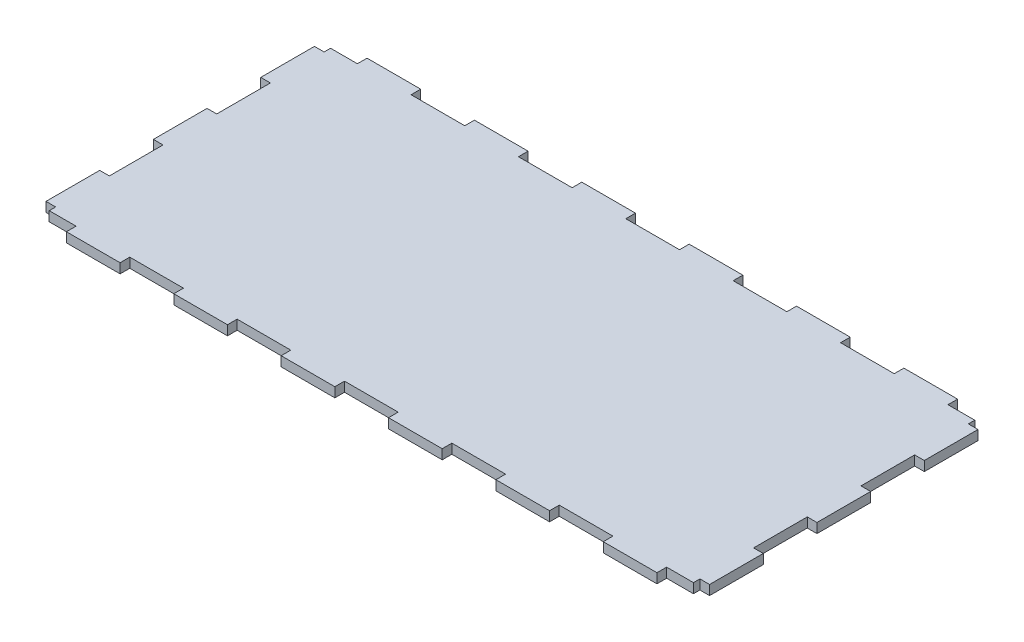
ISO-10303-21;
HEADER;
FILE_DESCRIPTION(('STEP AP214'),'2;1');
FILE_NAME('part.step','',(''),(''),'','','');
FILE_SCHEMA(('AUTOMOTIVE_DESIGN { 1 0 10303 214 1 1 1 1 }'));
ENDSEC;
DATA;
#1=APPLICATION_CONTEXT('core data for automotive mechanical design processes');
#2=APPLICATION_PROTOCOL_DEFINITION('international standard','automotive_design',2000,#1);
#3=PRODUCT_CONTEXT('',#1,'mechanical');
#4=PRODUCT('Part','Part','',(#3));
#5=PRODUCT_RELATED_PRODUCT_CATEGORY('part','',(#4));
#6=PRODUCT_DEFINITION_FORMATION('','',#4);
#7=PRODUCT_DEFINITION_CONTEXT('part definition',#1,'design');
#8=PRODUCT_DEFINITION('design','',#6,#7);
#9=PRODUCT_DEFINITION_SHAPE('','',#8);
#10=(LENGTH_UNIT() NAMED_UNIT(*) SI_UNIT(.MILLI.,.METRE.));
#11=(NAMED_UNIT(*) PLANE_ANGLE_UNIT() SI_UNIT($,.RADIAN.));
#12=(NAMED_UNIT(*) SI_UNIT($,.STERADIAN.) SOLID_ANGLE_UNIT());
#13=UNCERTAINTY_MEASURE_WITH_UNIT(LENGTH_MEASURE(1.E-05),#10,'distance_accuracy_value','');
#14=(GEOMETRIC_REPRESENTATION_CONTEXT(3) GLOBAL_UNCERTAINTY_ASSIGNED_CONTEXT((#13)) GLOBAL_UNIT_ASSIGNED_CONTEXT((#10,
#11,#12)) REPRESENTATION_CONTEXT('',''));
#15=CARTESIAN_POINT('',(0.,0.,0.));
#16=DIRECTION('',(0.,0.,1.));
#17=DIRECTION('',(1.,0.,0.));
#18=AXIS2_PLACEMENT_3D('',#15,#16,#17);
#19=CARTESIAN_POINT('',(-300.,9.,-256.));
#20=DIRECTION('',(1.,0.,1.11022302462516E-13));
#21=DIRECTION('',(1.11022302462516E-13,0.,-1.));
#22=AXIS2_PLACEMENT_3D('',#19,#20,#21);
#23=PLANE('',#22);
#24=DIRECTION('',(-1.11022302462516E-13,0.,1.));
#25=VECTOR('',#24,1.);
#26=CARTESIAN_POINT('',(-300.,0.,-256.));
#27=LINE('',#26,#25);
#28=CARTESIAN_POINT('',(-300.,0.,-256.));
#29=VERTEX_POINT('',#28);
#30=CARTESIAN_POINT('',(-300.000000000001,0.,-250.));
#31=VERTEX_POINT('',#30);
#32=EDGE_CURVE('E536',#29,#31,#27,.T.);
#33=ORIENTED_EDGE('',*,*,#32,.T.);
#34=DIRECTION('',(0.,-1.,0.));
#35=VECTOR('',#34,1.);
#36=CARTESIAN_POINT('',(-300.000000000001,9.,-250.));
#37=LINE('',#36,#35);
#38=CARTESIAN_POINT('',(-300.000000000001,9.,-250.));
#39=VERTEX_POINT('',#38);
#40=EDGE_CURVE('E11',#39,#31,#37,.T.);
#41=ORIENTED_EDGE('',*,*,#40,.F.);
#42=DIRECTION('',(-1.11022302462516E-13,0.,1.));
#43=VECTOR('',#42,1.);
#44=CARTESIAN_POINT('',(-300.,9.,-256.));
#45=LINE('',#44,#43);
#46=CARTESIAN_POINT('',(-300.,9.,-256.));
#47=VERTEX_POINT('',#46);
#48=EDGE_CURVE('E686',#47,#39,#45,.T.);
#49=ORIENTED_EDGE('',*,*,#48,.F.);
#50=DIRECTION('',(0.,-1.,0.));
#51=VECTOR('',#50,1.);
#52=CARTESIAN_POINT('',(-300.,9.,-256.));
#53=LINE('',#52,#51);
#54=EDGE_CURVE('E532',#47,#29,#53,.T.);
#55=ORIENTED_EDGE('',*,*,#54,.T.);
#56=EDGE_LOOP('',(#33,#41,#49,#55));
#57=FACE_BOUND('',#56,.T.);
#58=ADVANCED_FACE('F32',(#57),#23,.F.);
#59=CARTESIAN_POINT('',(-309.000000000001,9.,-250.));
#60=DIRECTION('',(0.,0.,1.));
#61=DIRECTION('',(1.,0.,0.));
#62=AXIS2_PLACEMENT_3D('',#59,#60,#61);
#63=PLANE('',#62);
#64=DIRECTION('',(-1.,0.,0.));
#65=VECTOR('',#64,1.);
#66=CARTESIAN_POINT('',(-309.000000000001,0.,-250.));
#67=LINE('',#66,#65);
#68=CARTESIAN_POINT('',(-309.000000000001,0.,-250.));
#69=VERTEX_POINT('',#68);
#70=EDGE_CURVE('E539',#31,#69,#67,.T.);
#71=ORIENTED_EDGE('',*,*,#70,.T.);
#72=DIRECTION('',(0.,-1.,0.));
#73=VECTOR('',#72,1.);
#74=CARTESIAN_POINT('',(-309.000000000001,9.,-250.));
#75=LINE('',#74,#73);
#76=CARTESIAN_POINT('',(-309.000000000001,9.,-250.));
#77=VERTEX_POINT('',#76);
#78=EDGE_CURVE('E40',#77,#69,#75,.T.);
#79=ORIENTED_EDGE('',*,*,#78,.F.);
#80=DIRECTION('',(-1.,0.,0.));
#81=VECTOR('',#80,1.);
#82=CARTESIAN_POINT('',(-309.000000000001,9.,-250.));
#83=LINE('',#82,#81);
#84=EDGE_CURVE('E295',#39,#77,#83,.T.);
#85=ORIENTED_EDGE('',*,*,#84,.F.);
#86=ORIENTED_EDGE('',*,*,#40,.T.);
#87=EDGE_LOOP('',(#71,#79,#85,#86));
#88=FACE_BOUND('',#87,.T.);
#89=ADVANCED_FACE('F1084',(#88),#63,.F.);
#90=CARTESIAN_POINT('',(-309.000000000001,9.,-200.));
#91=DIRECTION('',(1.,0.,0.));
#92=DIRECTION('',(0.,0.,-1.));
#93=AXIS2_PLACEMENT_3D('',#90,#91,#92);
#94=PLANE('',#93);
#95=DIRECTION('',(0.,0.,1.));
#96=VECTOR('',#95,1.);
#97=CARTESIAN_POINT('',(-309.000000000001,0.,-200.));
#98=LINE('',#97,#96);
#99=CARTESIAN_POINT('',(-309.000000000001,0.,-200.));
#100=VERTEX_POINT('',#99);
#101=EDGE_CURVE('E541',#69,#100,#98,.T.);
#102=ORIENTED_EDGE('',*,*,#101,.T.);
#103=DIRECTION('',(0.,-1.,0.));
#104=VECTOR('',#103,1.);
#105=CARTESIAN_POINT('',(-309.000000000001,9.,-200.));
#106=LINE('',#105,#104);
#107=CARTESIAN_POINT('',(-309.000000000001,9.,-200.));
#108=VERTEX_POINT('',#107);
#109=EDGE_CURVE('E897',#108,#100,#106,.T.);
#110=ORIENTED_EDGE('',*,*,#109,.F.);
#111=DIRECTION('',(0.,0.,1.));
#112=VECTOR('',#111,1.);
#113=CARTESIAN_POINT('',(-309.000000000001,9.,-200.));
#114=LINE('',#113,#112);
#115=EDGE_CURVE('E905',#77,#108,#114,.T.);
#116=ORIENTED_EDGE('',*,*,#115,.F.);
#117=ORIENTED_EDGE('',*,*,#78,.T.);
#118=EDGE_LOOP('',(#102,#110,#116,#117));
#119=FACE_BOUND('',#118,.T.);
#120=ADVANCED_FACE('F903',(#119),#94,.F.);
#121=CARTESIAN_POINT('',(-300.000000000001,9.,-200.));
#122=DIRECTION('',(0.,0.,-1.));
#123=DIRECTION('',(-1.,0.,0.));
#124=AXIS2_PLACEMENT_3D('',#121,#122,#123);
#125=PLANE('',#124);
#126=DIRECTION('',(1.,0.,0.));
#127=VECTOR('',#126,1.);
#128=CARTESIAN_POINT('',(-300.000000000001,0.,-200.));
#129=LINE('',#128,#127);
#130=CARTESIAN_POINT('',(-300.000000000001,0.,-200.));
#131=VERTEX_POINT('',#130);
#132=EDGE_CURVE('E543',#100,#131,#129,.T.);
#133=ORIENTED_EDGE('',*,*,#132,.T.);
#134=DIRECTION('',(0.,-1.,0.));
#135=VECTOR('',#134,1.);
#136=CARTESIAN_POINT('',(-300.000000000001,9.,-200.));
#137=LINE('',#136,#135);
#138=CARTESIAN_POINT('',(-300.000000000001,9.,-200.));
#139=VERTEX_POINT('',#138);
#140=EDGE_CURVE('E894',#139,#131,#137,.T.);
#141=ORIENTED_EDGE('',*,*,#140,.F.);
#142=DIRECTION('',(1.,0.,0.));
#143=VECTOR('',#142,1.);
#144=CARTESIAN_POINT('',(-300.000000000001,9.,-200.));
#145=LINE('',#144,#143);
#146=EDGE_CURVE('E923',#108,#139,#145,.T.);
#147=ORIENTED_EDGE('',*,*,#146,.F.);
#148=ORIENTED_EDGE('',*,*,#109,.T.);
#149=EDGE_LOOP('',(#133,#141,#147,#148));
#150=FACE_BOUND('',#149,.T.);
#151=ADVANCED_FACE('F914',(#150),#125,.F.);
#152=CARTESIAN_POINT('',(-300.000000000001,9.,-200.));
#153=DIRECTION('',(1.,0.,0.));
#154=DIRECTION('',(0.,0.,-1.));
#155=AXIS2_PLACEMENT_3D('',#152,#153,#154);
#156=PLANE('',#155);
#157=DIRECTION('',(0.,0.,1.));
#158=VECTOR('',#157,1.);
#159=CARTESIAN_POINT('',(-300.000000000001,0.,-200.));
#160=LINE('',#159,#158);
#161=CARTESIAN_POINT('',(-300.,0.,-150.));
#162=VERTEX_POINT('',#161);
#163=EDGE_CURVE('E545',#131,#162,#160,.T.);
#164=ORIENTED_EDGE('',*,*,#163,.T.);
#165=DIRECTION('',(0.,-1.,0.));
#166=VECTOR('',#165,1.);
#167=CARTESIAN_POINT('',(-300.,9.,-150.));
#168=LINE('',#167,#166);
#169=CARTESIAN_POINT('',(-300.,9.,-150.));
#170=VERTEX_POINT('',#169);
#171=EDGE_CURVE('E891',#170,#162,#168,.T.);
#172=ORIENTED_EDGE('',*,*,#171,.F.);
#173=DIRECTION('',(0.,0.,1.));
#174=VECTOR('',#173,1.);
#175=CARTESIAN_POINT('',(-300.000000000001,9.,-200.));
#176=LINE('',#175,#174);
#177=EDGE_CURVE('E920',#139,#170,#176,.T.);
#178=ORIENTED_EDGE('',*,*,#177,.F.);
#179=ORIENTED_EDGE('',*,*,#140,.T.);
#180=EDGE_LOOP('',(#164,#172,#178,#179));
#181=FACE_BOUND('',#180,.T.);
#182=ADVANCED_FACE('F918',(#181),#156,.F.);
#183=CARTESIAN_POINT('',(-309.,9.,-150.));
#184=DIRECTION('',(0.,0.,1.));
#185=DIRECTION('',(1.,0.,0.));
#186=AXIS2_PLACEMENT_3D('',#183,#184,#185);
#187=PLANE('',#186);
#188=DIRECTION('',(-1.,0.,0.));
#189=VECTOR('',#188,1.);
#190=CARTESIAN_POINT('',(-309.,0.,-150.));
#191=LINE('',#190,#189);
#192=CARTESIAN_POINT('',(-309.,0.,-150.));
#193=VERTEX_POINT('',#192);
#194=EDGE_CURVE('E547',#162,#193,#191,.T.);
#195=ORIENTED_EDGE('',*,*,#194,.T.);
#196=DIRECTION('',(0.,-1.,0.));
#197=VECTOR('',#196,1.);
#198=CARTESIAN_POINT('',(-309.,9.,-150.));
#199=LINE('',#198,#197);
#200=CARTESIAN_POINT('',(-309.,9.,-150.));
#201=VERTEX_POINT('',#200);
#202=EDGE_CURVE('E888',#201,#193,#199,.T.);
#203=ORIENTED_EDGE('',*,*,#202,.F.);
#204=DIRECTION('',(-1.,0.,0.));
#205=VECTOR('',#204,1.);
#206=CARTESIAN_POINT('',(-309.,9.,-150.));
#207=LINE('',#206,#205);
#208=EDGE_CURVE('E922',#170,#201,#207,.T.);
#209=ORIENTED_EDGE('',*,*,#208,.F.);
#210=ORIENTED_EDGE('',*,*,#171,.T.);
#211=EDGE_LOOP('',(#195,#203,#209,#210));
#212=FACE_BOUND('',#211,.T.);
#213=ADVANCED_FACE('F1097',(#212),#187,.F.);
#214=CARTESIAN_POINT('',(-309.,9.,-100.));
#215=DIRECTION('',(1.,0.,0.));
#216=DIRECTION('',(0.,0.,-1.));
#217=AXIS2_PLACEMENT_3D('',#214,#215,#216);
#218=PLANE('',#217);
#219=DIRECTION('',(0.,0.,1.));
#220=VECTOR('',#219,1.);
#221=CARTESIAN_POINT('',(-309.,0.,-100.));
#222=LINE('',#221,#220);
#223=CARTESIAN_POINT('',(-309.,0.,-100.));
#224=VERTEX_POINT('',#223);
#225=EDGE_CURVE('E549',#193,#224,#222,.T.);
#226=ORIENTED_EDGE('',*,*,#225,.T.);
#227=DIRECTION('',(0.,-1.,0.));
#228=VECTOR('',#227,1.);
#229=CARTESIAN_POINT('',(-309.,9.,-100.));
#230=LINE('',#229,#228);
#231=CARTESIAN_POINT('',(-309.,9.,-100.));
#232=VERTEX_POINT('',#231);
#233=EDGE_CURVE('E885',#232,#224,#230,.T.);
#234=ORIENTED_EDGE('',*,*,#233,.F.);
#235=DIRECTION('',(0.,0.,1.));
#236=VECTOR('',#235,1.);
#237=CARTESIAN_POINT('',(-309.,9.,-100.));
#238=LINE('',#237,#236);
#239=EDGE_CURVE('E925',#201,#232,#238,.T.);
#240=ORIENTED_EDGE('',*,*,#239,.F.);
#241=ORIENTED_EDGE('',*,*,#202,.T.);
#242=EDGE_LOOP('',(#226,#234,#240,#241));
#243=FACE_BOUND('',#242,.T.);
#244=ADVANCED_FACE('F1100',(#243),#218,.F.);
#245=CARTESIAN_POINT('',(-300.,9.,-100.));
#246=DIRECTION('',(0.,0.,-1.));
#247=DIRECTION('',(-1.,0.,0.));
#248=AXIS2_PLACEMENT_3D('',#245,#246,#247);
#249=PLANE('',#248);
#250=DIRECTION('',(1.,0.,0.));
#251=VECTOR('',#250,1.);
#252=CARTESIAN_POINT('',(-300.,0.,-100.));
#253=LINE('',#252,#251);
#254=CARTESIAN_POINT('',(-300.,0.,-100.));
#255=VERTEX_POINT('',#254);
#256=EDGE_CURVE('E551',#224,#255,#253,.T.);
#257=ORIENTED_EDGE('',*,*,#256,.T.);
#258=DIRECTION('',(0.,-1.,0.));
#259=VECTOR('',#258,1.);
#260=CARTESIAN_POINT('',(-300.,9.,-100.));
#261=LINE('',#260,#259);
#262=CARTESIAN_POINT('',(-300.,9.,-100.));
#263=VERTEX_POINT('',#262);
#264=EDGE_CURVE('E882',#263,#255,#261,.T.);
#265=ORIENTED_EDGE('',*,*,#264,.F.);
#266=DIRECTION('',(1.,0.,0.));
#267=VECTOR('',#266,1.);
#268=CARTESIAN_POINT('',(-300.,9.,-100.));
#269=LINE('',#268,#267);
#270=EDGE_CURVE('E931',#232,#263,#269,.T.);
#271=ORIENTED_EDGE('',*,*,#270,.F.);
#272=ORIENTED_EDGE('',*,*,#233,.T.);
#273=EDGE_LOOP('',(#257,#265,#271,#272));
#274=FACE_BOUND('',#273,.T.);
#275=ADVANCED_FACE('F1104',(#274),#249,.F.);
#276=CARTESIAN_POINT('',(-300.,9.,-100.));
#277=DIRECTION('',(1.,0.,0.));
#278=DIRECTION('',(0.,0.,-1.));
#279=AXIS2_PLACEMENT_3D('',#276,#277,#278);
#280=PLANE('',#279);
#281=DIRECTION('',(0.,0.,1.));
#282=VECTOR('',#281,1.);
#283=CARTESIAN_POINT('',(-300.,0.,-100.));
#284=LINE('',#283,#282);
#285=CARTESIAN_POINT('',(-300.,0.,-50.));
#286=VERTEX_POINT('',#285);
#287=EDGE_CURVE('E553',#255,#286,#284,.T.);
#288=ORIENTED_EDGE('',*,*,#287,.T.);
#289=DIRECTION('',(0.,-1.,0.));
#290=VECTOR('',#289,1.);
#291=CARTESIAN_POINT('',(-300.,9.,-50.));
#292=LINE('',#291,#290);
#293=CARTESIAN_POINT('',(-300.,9.,-50.));
#294=VERTEX_POINT('',#293);
#295=EDGE_CURVE('E879',#294,#286,#292,.T.);
#296=ORIENTED_EDGE('',*,*,#295,.F.);
#297=DIRECTION('',(0.,0.,1.));
#298=VECTOR('',#297,1.);
#299=CARTESIAN_POINT('',(-300.,9.,-100.));
#300=LINE('',#299,#298);
#301=EDGE_CURVE('E933',#263,#294,#300,.T.);
#302=ORIENTED_EDGE('',*,*,#301,.F.);
#303=ORIENTED_EDGE('',*,*,#264,.T.);
#304=EDGE_LOOP('',(#288,#296,#302,#303));
#305=FACE_BOUND('',#304,.T.);
#306=ADVANCED_FACE('F1108',(#305),#280,.F.);
#307=CARTESIAN_POINT('',(-309.,9.,-50.));
#308=DIRECTION('',(0.,0.,1.));
#309=DIRECTION('',(1.,0.,0.));
#310=AXIS2_PLACEMENT_3D('',#307,#308,#309);
#311=PLANE('',#310);
#312=DIRECTION('',(-1.,0.,0.));
#313=VECTOR('',#312,1.);
#314=CARTESIAN_POINT('',(-309.,0.,-50.));
#315=LINE('',#314,#313);
#316=CARTESIAN_POINT('',(-309.,0.,-50.));
#317=VERTEX_POINT('',#316);
#318=EDGE_CURVE('E555',#286,#317,#315,.T.);
#319=ORIENTED_EDGE('',*,*,#318,.T.);
#320=DIRECTION('',(0.,-1.,0.));
#321=VECTOR('',#320,1.);
#322=CARTESIAN_POINT('',(-309.,9.,-50.));
#323=LINE('',#322,#321);
#324=CARTESIAN_POINT('',(-309.,9.,-50.));
#325=VERTEX_POINT('',#324);
#326=EDGE_CURVE('E876',#325,#317,#323,.T.);
#327=ORIENTED_EDGE('',*,*,#326,.F.);
#328=DIRECTION('',(-1.,0.,0.));
#329=VECTOR('',#328,1.);
#330=CARTESIAN_POINT('',(-309.,9.,-50.));
#331=LINE('',#330,#329);
#332=EDGE_CURVE('E935',#294,#325,#331,.T.);
#333=ORIENTED_EDGE('',*,*,#332,.F.);
#334=ORIENTED_EDGE('',*,*,#295,.T.);
#335=EDGE_LOOP('',(#319,#327,#333,#334));
#336=FACE_BOUND('',#335,.T.);
#337=ADVANCED_FACE('F1112',(#336),#311,.F.);
#338=CARTESIAN_POINT('',(-309.,9.,0.));
#339=DIRECTION('',(1.,0.,0.));
#340=DIRECTION('',(0.,0.,-1.));
#341=AXIS2_PLACEMENT_3D('',#338,#339,#340);
#342=PLANE('',#341);
#343=DIRECTION('',(0.,0.,1.));
#344=VECTOR('',#343,1.);
#345=CARTESIAN_POINT('',(-309.,0.,0.));
#346=LINE('',#345,#344);
#347=CARTESIAN_POINT('',(-309.,0.,0.));
#348=VERTEX_POINT('',#347);
#349=EDGE_CURVE('E557',#317,#348,#346,.T.);
#350=ORIENTED_EDGE('',*,*,#349,.T.);
#351=DIRECTION('',(0.,-1.,0.));
#352=VECTOR('',#351,1.);
#353=CARTESIAN_POINT('',(-309.,9.,0.));
#354=LINE('',#353,#352);
#355=CARTESIAN_POINT('',(-309.,9.,0.));
#356=VERTEX_POINT('',#355);
#357=EDGE_CURVE('E873',#356,#348,#354,.T.);
#358=ORIENTED_EDGE('',*,*,#357,.F.);
#359=DIRECTION('',(0.,0.,1.));
#360=VECTOR('',#359,1.);
#361=CARTESIAN_POINT('',(-309.,9.,0.));
#362=LINE('',#361,#360);
#363=EDGE_CURVE('E937',#325,#356,#362,.T.);
#364=ORIENTED_EDGE('',*,*,#363,.F.);
#365=ORIENTED_EDGE('',*,*,#326,.T.);
#366=EDGE_LOOP('',(#350,#358,#364,#365));
#367=FACE_BOUND('',#366,.T.);
#368=ADVANCED_FACE('F1116',(#367),#342,.F.);
#369=CARTESIAN_POINT('',(-300.,9.,0.));
#370=DIRECTION('',(0.,0.,-1.));
#371=DIRECTION('',(-1.,0.,0.));
#372=AXIS2_PLACEMENT_3D('',#369,#370,#371);
#373=PLANE('',#372);
#374=DIRECTION('',(1.,0.,0.));
#375=VECTOR('',#374,1.);
#376=CARTESIAN_POINT('',(-300.,0.,0.));
#377=LINE('',#376,#375);
#378=CARTESIAN_POINT('',(-300.,0.,0.));
#379=VERTEX_POINT('',#378);
#380=EDGE_CURVE('E559',#348,#379,#377,.T.);
#381=ORIENTED_EDGE('',*,*,#380,.T.);
#382=DIRECTION('',(0.,-1.,0.));
#383=VECTOR('',#382,1.);
#384=CARTESIAN_POINT('',(-300.,9.,0.));
#385=LINE('',#384,#383);
#386=CARTESIAN_POINT('',(-300.,9.,0.));
#387=VERTEX_POINT('',#386);
#388=EDGE_CURVE('E870',#387,#379,#385,.T.);
#389=ORIENTED_EDGE('',*,*,#388,.F.);
#390=DIRECTION('',(1.,0.,0.));
#391=VECTOR('',#390,1.);
#392=CARTESIAN_POINT('',(-300.,9.,0.));
#393=LINE('',#392,#391);
#394=EDGE_CURVE('E939',#356,#387,#393,.T.);
#395=ORIENTED_EDGE('',*,*,#394,.F.);
#396=ORIENTED_EDGE('',*,*,#357,.T.);
#397=EDGE_LOOP('',(#381,#389,#395,#396));
#398=FACE_BOUND('',#397,.T.);
#399=ADVANCED_FACE('F1120',(#398),#373,.F.);
#400=CARTESIAN_POINT('',(-300.,9.,0.));
#401=DIRECTION('',(1.,0.,0.));
#402=DIRECTION('',(0.,0.,-1.));
#403=AXIS2_PLACEMENT_3D('',#400,#401,#402);
#404=PLANE('',#403);
#405=DIRECTION('',(0.,0.,1.));
#406=VECTOR('',#405,1.);
#407=CARTESIAN_POINT('',(-300.,0.,0.));
#408=LINE('',#407,#406);
#409=CARTESIAN_POINT('',(-300.,0.,6.));
#410=VERTEX_POINT('',#409);
#411=EDGE_CURVE('E561',#379,#410,#408,.T.);
#412=ORIENTED_EDGE('',*,*,#411,.T.);
#413=DIRECTION('',(0.,-1.,0.));
#414=VECTOR('',#413,1.);
#415=CARTESIAN_POINT('',(-300.,9.,6.));
#416=LINE('',#415,#414);
#417=CARTESIAN_POINT('',(-300.,9.,6.));
#418=VERTEX_POINT('',#417);
#419=EDGE_CURVE('E867',#418,#410,#416,.T.);
#420=ORIENTED_EDGE('',*,*,#419,.F.);
#421=DIRECTION('',(0.,0.,1.));
#422=VECTOR('',#421,1.);
#423=CARTESIAN_POINT('',(-300.,9.,0.));
#424=LINE('',#423,#422);
#425=EDGE_CURVE('E941',#387,#418,#424,.T.);
#426=ORIENTED_EDGE('',*,*,#425,.F.);
#427=ORIENTED_EDGE('',*,*,#388,.T.);
#428=EDGE_LOOP('',(#412,#420,#426,#427));
#429=FACE_BOUND('',#428,.T.);
#430=ADVANCED_FACE('F1124',(#429),#404,.F.);
#431=CARTESIAN_POINT('',(-300.,9.,6.));
#432=DIRECTION('',(0.,0.,-1.));
#433=DIRECTION('',(-1.,0.,0.));
#434=AXIS2_PLACEMENT_3D('',#431,#432,#433);
#435=PLANE('',#434);
#436=DIRECTION('',(1.,0.,0.));
#437=VECTOR('',#436,1.);
#438=CARTESIAN_POINT('',(-300.,0.,6.));
#439=LINE('',#438,#437);
#440=CARTESIAN_POINT('',(-275.,0.,6.));
#441=VERTEX_POINT('',#440);
#442=EDGE_CURVE('E563',#410,#441,#439,.T.);
#443=ORIENTED_EDGE('',*,*,#442,.T.);
#444=DIRECTION('',(0.,-1.,0.));
#445=VECTOR('',#444,1.);
#446=CARTESIAN_POINT('',(-275.,9.,6.));
#447=LINE('',#446,#445);
#448=CARTESIAN_POINT('',(-275.,9.,6.));
#449=VERTEX_POINT('',#448);
#450=EDGE_CURVE('E864',#449,#441,#447,.T.);
#451=ORIENTED_EDGE('',*,*,#450,.F.);
#452=DIRECTION('',(1.,0.,0.));
#453=VECTOR('',#452,1.);
#454=CARTESIAN_POINT('',(-300.,9.,6.));
#455=LINE('',#454,#453);
#456=EDGE_CURVE('E943',#418,#449,#455,.T.);
#457=ORIENTED_EDGE('',*,*,#456,.F.);
#458=ORIENTED_EDGE('',*,*,#419,.T.);
#459=EDGE_LOOP('',(#443,#451,#457,#458));
#460=FACE_BOUND('',#459,.T.);
#461=ADVANCED_FACE('F1128',(#460),#435,.F.);
#462=CARTESIAN_POINT('',(-275.,9.,6.));
#463=DIRECTION('',(1.,0.,0.));
#464=DIRECTION('',(0.,0.,-1.));
#465=AXIS2_PLACEMENT_3D('',#462,#463,#464);
#466=PLANE('',#465);
#467=DIRECTION('',(0.,0.,1.));
#468=VECTOR('',#467,1.);
#469=CARTESIAN_POINT('',(-275.,0.,6.));
#470=LINE('',#469,#468);
#471=CARTESIAN_POINT('',(-275.,0.,15.));
#472=VERTEX_POINT('',#471);
#473=EDGE_CURVE('E565',#441,#472,#470,.T.);
#474=ORIENTED_EDGE('',*,*,#473,.T.);
#475=DIRECTION('',(0.,-1.,0.));
#476=VECTOR('',#475,1.);
#477=CARTESIAN_POINT('',(-275.,9.,15.));
#478=LINE('',#477,#476);
#479=CARTESIAN_POINT('',(-275.,9.,15.));
#480=VERTEX_POINT('',#479);
#481=EDGE_CURVE('E861',#480,#472,#478,.T.);
#482=ORIENTED_EDGE('',*,*,#481,.F.);
#483=DIRECTION('',(0.,0.,1.));
#484=VECTOR('',#483,1.);
#485=CARTESIAN_POINT('',(-275.,9.,6.));
#486=LINE('',#485,#484);
#487=EDGE_CURVE('E945',#449,#480,#486,.T.);
#488=ORIENTED_EDGE('',*,*,#487,.F.);
#489=ORIENTED_EDGE('',*,*,#450,.T.);
#490=EDGE_LOOP('',(#474,#482,#488,#489));
#491=FACE_BOUND('',#490,.T.);
#492=ADVANCED_FACE('F1132',(#491),#466,.F.);
#493=CARTESIAN_POINT('',(-275.,9.,15.));
#494=DIRECTION('',(0.,0.,-1.));
#495=DIRECTION('',(-1.,0.,0.));
#496=AXIS2_PLACEMENT_3D('',#493,#494,#495);
#497=PLANE('',#496);
#498=DIRECTION('',(1.,0.,0.));
#499=VECTOR('',#498,1.);
#500=CARTESIAN_POINT('',(-275.,0.,15.));
#501=LINE('',#500,#499);
#502=CARTESIAN_POINT('',(-225.,0.,15.));
#503=VERTEX_POINT('',#502);
#504=EDGE_CURVE('E567',#472,#503,#501,.T.);
#505=ORIENTED_EDGE('',*,*,#504,.T.);
#506=DIRECTION('',(0.,-1.,0.));
#507=VECTOR('',#506,1.);
#508=CARTESIAN_POINT('',(-225.,9.,15.));
#509=LINE('',#508,#507);
#510=CARTESIAN_POINT('',(-225.,9.,15.));
#511=VERTEX_POINT('',#510);
#512=EDGE_CURVE('E858',#511,#503,#509,.T.);
#513=ORIENTED_EDGE('',*,*,#512,.F.);
#514=DIRECTION('',(1.,0.,0.));
#515=VECTOR('',#514,1.);
#516=CARTESIAN_POINT('',(-275.,9.,15.));
#517=LINE('',#516,#515);
#518=EDGE_CURVE('E947',#480,#511,#517,.T.);
#519=ORIENTED_EDGE('',*,*,#518,.F.);
#520=ORIENTED_EDGE('',*,*,#481,.T.);
#521=EDGE_LOOP('',(#505,#513,#519,#520));
#522=FACE_BOUND('',#521,.T.);
#523=ADVANCED_FACE('F1136',(#522),#497,.F.);
#524=CARTESIAN_POINT('',(-225.,9.,15.));
#525=DIRECTION('',(-1.,0.,0.));
#526=DIRECTION('',(0.,0.,1.));
#527=AXIS2_PLACEMENT_3D('',#524,#525,#526);
#528=PLANE('',#527);
#529=DIRECTION('',(0.,0.,-1.));
#530=VECTOR('',#529,1.);
#531=CARTESIAN_POINT('',(-225.,0.,15.));
#532=LINE('',#531,#530);
#533=CARTESIAN_POINT('',(-225.,0.,6.));
#534=VERTEX_POINT('',#533);
#535=EDGE_CURVE('E569',#503,#534,#532,.T.);
#536=ORIENTED_EDGE('',*,*,#535,.T.);
#537=DIRECTION('',(0.,-1.,0.));
#538=VECTOR('',#537,1.);
#539=CARTESIAN_POINT('',(-225.,9.,6.));
#540=LINE('',#539,#538);
#541=CARTESIAN_POINT('',(-225.,9.,6.));
#542=VERTEX_POINT('',#541);
#543=EDGE_CURVE('E855',#542,#534,#540,.T.);
#544=ORIENTED_EDGE('',*,*,#543,.F.);
#545=DIRECTION('',(0.,0.,-1.));
#546=VECTOR('',#545,1.);
#547=CARTESIAN_POINT('',(-225.,9.,15.));
#548=LINE('',#547,#546);
#549=EDGE_CURVE('E949',#511,#542,#548,.T.);
#550=ORIENTED_EDGE('',*,*,#549,.F.);
#551=ORIENTED_EDGE('',*,*,#512,.T.);
#552=EDGE_LOOP('',(#536,#544,#550,#551));
#553=FACE_BOUND('',#552,.T.);
#554=ADVANCED_FACE('F1140',(#553),#528,.F.);
#555=CARTESIAN_POINT('',(-225.,9.,6.));
#556=DIRECTION('',(0.,0.,-1.));
#557=DIRECTION('',(-1.,0.,0.));
#558=AXIS2_PLACEMENT_3D('',#555,#556,#557);
#559=PLANE('',#558);
#560=DIRECTION('',(1.,0.,0.));
#561=VECTOR('',#560,1.);
#562=CARTESIAN_POINT('',(-225.,0.,6.));
#563=LINE('',#562,#561);
#564=CARTESIAN_POINT('',(-175.,0.,6.));
#565=VERTEX_POINT('',#564);
#566=EDGE_CURVE('E571',#534,#565,#563,.T.);
#567=ORIENTED_EDGE('',*,*,#566,.T.);
#568=DIRECTION('',(0.,-1.,0.));
#569=VECTOR('',#568,1.);
#570=CARTESIAN_POINT('',(-175.,9.,6.));
#571=LINE('',#570,#569);
#572=CARTESIAN_POINT('',(-175.,9.,6.));
#573=VERTEX_POINT('',#572);
#574=EDGE_CURVE('E852',#573,#565,#571,.T.);
#575=ORIENTED_EDGE('',*,*,#574,.F.);
#576=DIRECTION('',(1.,0.,0.));
#577=VECTOR('',#576,1.);
#578=CARTESIAN_POINT('',(-225.,9.,6.));
#579=LINE('',#578,#577);
#580=EDGE_CURVE('E951',#542,#573,#579,.T.);
#581=ORIENTED_EDGE('',*,*,#580,.F.);
#582=ORIENTED_EDGE('',*,*,#543,.T.);
#583=EDGE_LOOP('',(#567,#575,#581,#582));
#584=FACE_BOUND('',#583,.T.);
#585=ADVANCED_FACE('F1144',(#584),#559,.F.);
#586=CARTESIAN_POINT('',(-175.,9.,6.));
#587=DIRECTION('',(1.,0.,0.));
#588=DIRECTION('',(0.,0.,-1.));
#589=AXIS2_PLACEMENT_3D('',#586,#587,#588);
#590=PLANE('',#589);
#591=DIRECTION('',(0.,0.,1.));
#592=VECTOR('',#591,1.);
#593=CARTESIAN_POINT('',(-175.,0.,6.));
#594=LINE('',#593,#592);
#595=CARTESIAN_POINT('',(-175.,0.,15.));
#596=VERTEX_POINT('',#595);
#597=EDGE_CURVE('E573',#565,#596,#594,.T.);
#598=ORIENTED_EDGE('',*,*,#597,.T.);
#599=DIRECTION('',(0.,-1.,0.));
#600=VECTOR('',#599,1.);
#601=CARTESIAN_POINT('',(-175.,9.,15.));
#602=LINE('',#601,#600);
#603=CARTESIAN_POINT('',(-175.,9.,15.));
#604=VERTEX_POINT('',#603);
#605=EDGE_CURVE('E849',#604,#596,#602,.T.);
#606=ORIENTED_EDGE('',*,*,#605,.F.);
#607=DIRECTION('',(0.,0.,1.));
#608=VECTOR('',#607,1.);
#609=CARTESIAN_POINT('',(-175.,9.,6.));
#610=LINE('',#609,#608);
#611=EDGE_CURVE('E953',#573,#604,#610,.T.);
#612=ORIENTED_EDGE('',*,*,#611,.F.);
#613=ORIENTED_EDGE('',*,*,#574,.T.);
#614=EDGE_LOOP('',(#598,#606,#612,#613));
#615=FACE_BOUND('',#614,.T.);
#616=ADVANCED_FACE('F1148',(#615),#590,.F.);
#617=CARTESIAN_POINT('',(-175.,9.,15.));
#618=DIRECTION('',(0.,0.,-1.));
#619=DIRECTION('',(-1.,0.,0.));
#620=AXIS2_PLACEMENT_3D('',#617,#618,#619);
#621=PLANE('',#620);
#622=DIRECTION('',(1.,0.,0.));
#623=VECTOR('',#622,1.);
#624=CARTESIAN_POINT('',(-175.,0.,15.));
#625=LINE('',#624,#623);
#626=CARTESIAN_POINT('',(-125.,0.,15.));
#627=VERTEX_POINT('',#626);
#628=EDGE_CURVE('E575',#596,#627,#625,.T.);
#629=ORIENTED_EDGE('',*,*,#628,.T.);
#630=DIRECTION('',(0.,-1.,0.));
#631=VECTOR('',#630,1.);
#632=CARTESIAN_POINT('',(-125.,9.,15.));
#633=LINE('',#632,#631);
#634=CARTESIAN_POINT('',(-125.,9.,15.));
#635=VERTEX_POINT('',#634);
#636=EDGE_CURVE('E846',#635,#627,#633,.T.);
#637=ORIENTED_EDGE('',*,*,#636,.F.);
#638=DIRECTION('',(1.,0.,0.));
#639=VECTOR('',#638,1.);
#640=CARTESIAN_POINT('',(-175.,9.,15.));
#641=LINE('',#640,#639);
#642=EDGE_CURVE('E955',#604,#635,#641,.T.);
#643=ORIENTED_EDGE('',*,*,#642,.F.);
#644=ORIENTED_EDGE('',*,*,#605,.T.);
#645=EDGE_LOOP('',(#629,#637,#643,#644));
#646=FACE_BOUND('',#645,.T.);
#647=ADVANCED_FACE('F1152',(#646),#621,.F.);
#648=CARTESIAN_POINT('',(-125.,9.,15.));
#649=DIRECTION('',(-1.,0.,0.));
#650=DIRECTION('',(0.,0.,1.));
#651=AXIS2_PLACEMENT_3D('',#648,#649,#650);
#652=PLANE('',#651);
#653=DIRECTION('',(0.,0.,-1.));
#654=VECTOR('',#653,1.);
#655=CARTESIAN_POINT('',(-125.,0.,15.));
#656=LINE('',#655,#654);
#657=CARTESIAN_POINT('',(-125.,0.,6.));
#658=VERTEX_POINT('',#657);
#659=EDGE_CURVE('E577',#627,#658,#656,.T.);
#660=ORIENTED_EDGE('',*,*,#659,.T.);
#661=DIRECTION('',(0.,-1.,0.));
#662=VECTOR('',#661,1.);
#663=CARTESIAN_POINT('',(-125.,9.,6.));
#664=LINE('',#663,#662);
#665=CARTESIAN_POINT('',(-125.,9.,6.));
#666=VERTEX_POINT('',#665);
#667=EDGE_CURVE('E843',#666,#658,#664,.T.);
#668=ORIENTED_EDGE('',*,*,#667,.F.);
#669=DIRECTION('',(0.,0.,-1.));
#670=VECTOR('',#669,1.);
#671=CARTESIAN_POINT('',(-125.,9.,15.));
#672=LINE('',#671,#670);
#673=EDGE_CURVE('E957',#635,#666,#672,.T.);
#674=ORIENTED_EDGE('',*,*,#673,.F.);
#675=ORIENTED_EDGE('',*,*,#636,.T.);
#676=EDGE_LOOP('',(#660,#668,#674,#675));
#677=FACE_BOUND('',#676,.T.);
#678=ADVANCED_FACE('F1156',(#677),#652,.F.);
#679=CARTESIAN_POINT('',(-125.,9.,6.));
#680=DIRECTION('',(0.,0.,-1.));
#681=DIRECTION('',(-1.,0.,0.));
#682=AXIS2_PLACEMENT_3D('',#679,#680,#681);
#683=PLANE('',#682);
#684=DIRECTION('',(1.,0.,0.));
#685=VECTOR('',#684,1.);
#686=CARTESIAN_POINT('',(-125.,0.,6.));
#687=LINE('',#686,#685);
#688=CARTESIAN_POINT('',(-75.,0.,6.));
#689=VERTEX_POINT('',#688);
#690=EDGE_CURVE('E579',#658,#689,#687,.T.);
#691=ORIENTED_EDGE('',*,*,#690,.T.);
#692=DIRECTION('',(0.,-1.,0.));
#693=VECTOR('',#692,1.);
#694=CARTESIAN_POINT('',(-75.,9.,6.));
#695=LINE('',#694,#693);
#696=CARTESIAN_POINT('',(-75.,9.,6.));
#697=VERTEX_POINT('',#696);
#698=EDGE_CURVE('E840',#697,#689,#695,.T.);
#699=ORIENTED_EDGE('',*,*,#698,.F.);
#700=DIRECTION('',(1.,0.,0.));
#701=VECTOR('',#700,1.);
#702=CARTESIAN_POINT('',(-125.,9.,6.));
#703=LINE('',#702,#701);
#704=EDGE_CURVE('E959',#666,#697,#703,.T.);
#705=ORIENTED_EDGE('',*,*,#704,.F.);
#706=ORIENTED_EDGE('',*,*,#667,.T.);
#707=EDGE_LOOP('',(#691,#699,#705,#706));
#708=FACE_BOUND('',#707,.T.);
#709=ADVANCED_FACE('F1160',(#708),#683,.F.);
#710=CARTESIAN_POINT('',(-75.,9.,6.));
#711=DIRECTION('',(1.,0.,0.));
#712=DIRECTION('',(0.,0.,-1.));
#713=AXIS2_PLACEMENT_3D('',#710,#711,#712);
#714=PLANE('',#713);
#715=DIRECTION('',(0.,0.,1.));
#716=VECTOR('',#715,1.);
#717=CARTESIAN_POINT('',(-75.,0.,6.));
#718=LINE('',#717,#716);
#719=CARTESIAN_POINT('',(-75.,0.,15.));
#720=VERTEX_POINT('',#719);
#721=EDGE_CURVE('E581',#689,#720,#718,.T.);
#722=ORIENTED_EDGE('',*,*,#721,.T.);
#723=DIRECTION('',(0.,-1.,0.));
#724=VECTOR('',#723,1.);
#725=CARTESIAN_POINT('',(-75.,9.,15.));
#726=LINE('',#725,#724);
#727=CARTESIAN_POINT('',(-75.,9.,15.));
#728=VERTEX_POINT('',#727);
#729=EDGE_CURVE('E837',#728,#720,#726,.T.);
#730=ORIENTED_EDGE('',*,*,#729,.F.);
#731=DIRECTION('',(0.,0.,1.));
#732=VECTOR('',#731,1.);
#733=CARTESIAN_POINT('',(-75.,9.,6.));
#734=LINE('',#733,#732);
#735=EDGE_CURVE('E961',#697,#728,#734,.T.);
#736=ORIENTED_EDGE('',*,*,#735,.F.);
#737=ORIENTED_EDGE('',*,*,#698,.T.);
#738=EDGE_LOOP('',(#722,#730,#736,#737));
#739=FACE_BOUND('',#738,.T.);
#740=ADVANCED_FACE('F1164',(#739),#714,.F.);
#741=CARTESIAN_POINT('',(-75.,9.,15.));
#742=DIRECTION('',(0.,0.,-1.));
#743=DIRECTION('',(-1.,0.,0.));
#744=AXIS2_PLACEMENT_3D('',#741,#742,#743);
#745=PLANE('',#744);
#746=DIRECTION('',(1.,0.,0.));
#747=VECTOR('',#746,1.);
#748=CARTESIAN_POINT('',(-75.,0.,15.));
#749=LINE('',#748,#747);
#750=CARTESIAN_POINT('',(-25.,0.,15.));
#751=VERTEX_POINT('',#750);
#752=EDGE_CURVE('E583',#720,#751,#749,.T.);
#753=ORIENTED_EDGE('',*,*,#752,.T.);
#754=DIRECTION('',(0.,-1.,0.));
#755=VECTOR('',#754,1.);
#756=CARTESIAN_POINT('',(-25.,9.,15.));
#757=LINE('',#756,#755);
#758=CARTESIAN_POINT('',(-25.,9.,15.));
#759=VERTEX_POINT('',#758);
#760=EDGE_CURVE('E834',#759,#751,#757,.T.);
#761=ORIENTED_EDGE('',*,*,#760,.F.);
#762=DIRECTION('',(1.,0.,0.));
#763=VECTOR('',#762,1.);
#764=CARTESIAN_POINT('',(-75.,9.,15.));
#765=LINE('',#764,#763);
#766=EDGE_CURVE('E963',#728,#759,#765,.T.);
#767=ORIENTED_EDGE('',*,*,#766,.F.);
#768=ORIENTED_EDGE('',*,*,#729,.T.);
#769=EDGE_LOOP('',(#753,#761,#767,#768));
#770=FACE_BOUND('',#769,.T.);
#771=ADVANCED_FACE('F1168',(#770),#745,.F.);
#772=CARTESIAN_POINT('',(-25.,9.,15.));
#773=DIRECTION('',(-1.,0.,0.));
#774=DIRECTION('',(0.,0.,1.));
#775=AXIS2_PLACEMENT_3D('',#772,#773,#774);
#776=PLANE('',#775);
#777=DIRECTION('',(0.,0.,-1.));
#778=VECTOR('',#777,1.);
#779=CARTESIAN_POINT('',(-25.,0.,15.));
#780=LINE('',#779,#778);
#781=CARTESIAN_POINT('',(-25.,0.,6.));
#782=VERTEX_POINT('',#781);
#783=EDGE_CURVE('E585',#751,#782,#780,.T.);
#784=ORIENTED_EDGE('',*,*,#783,.T.);
#785=DIRECTION('',(0.,-1.,0.));
#786=VECTOR('',#785,1.);
#787=CARTESIAN_POINT('',(-25.,9.,6.));
#788=LINE('',#787,#786);
#789=CARTESIAN_POINT('',(-25.,9.,6.));
#790=VERTEX_POINT('',#789);
#791=EDGE_CURVE('E831',#790,#782,#788,.T.);
#792=ORIENTED_EDGE('',*,*,#791,.F.);
#793=DIRECTION('',(0.,0.,-1.));
#794=VECTOR('',#793,1.);
#795=CARTESIAN_POINT('',(-25.,9.,15.));
#796=LINE('',#795,#794);
#797=EDGE_CURVE('E965',#759,#790,#796,.T.);
#798=ORIENTED_EDGE('',*,*,#797,.F.);
#799=ORIENTED_EDGE('',*,*,#760,.T.);
#800=EDGE_LOOP('',(#784,#792,#798,#799));
#801=FACE_BOUND('',#800,.T.);
#802=ADVANCED_FACE('F1172',(#801),#776,.F.);
#803=CARTESIAN_POINT('',(-25.,9.,6.));
#804=DIRECTION('',(0.,0.,-1.));
#805=DIRECTION('',(-1.,0.,0.));
#806=AXIS2_PLACEMENT_3D('',#803,#804,#805);
#807=PLANE('',#806);
#808=DIRECTION('',(1.,0.,0.));
#809=VECTOR('',#808,1.);
#810=CARTESIAN_POINT('',(-25.,0.,6.));
#811=LINE('',#810,#809);
#812=CARTESIAN_POINT('',(25.0000000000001,0.,6.));
#813=VERTEX_POINT('',#812);
#814=EDGE_CURVE('E587',#782,#813,#811,.T.);
#815=ORIENTED_EDGE('',*,*,#814,.T.);
#816=DIRECTION('',(0.,-1.,0.));
#817=VECTOR('',#816,1.);
#818=CARTESIAN_POINT('',(25.0000000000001,9.,6.));
#819=LINE('',#818,#817);
#820=CARTESIAN_POINT('',(25.0000000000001,9.,6.));
#821=VERTEX_POINT('',#820);
#822=EDGE_CURVE('E828',#821,#813,#819,.T.);
#823=ORIENTED_EDGE('',*,*,#822,.F.);
#824=DIRECTION('',(1.,0.,0.));
#825=VECTOR('',#824,1.);
#826=CARTESIAN_POINT('',(-25.,9.,6.));
#827=LINE('',#826,#825);
#828=EDGE_CURVE('E967',#790,#821,#827,.T.);
#829=ORIENTED_EDGE('',*,*,#828,.F.);
#830=ORIENTED_EDGE('',*,*,#791,.T.);
#831=EDGE_LOOP('',(#815,#823,#829,#830));
#832=FACE_BOUND('',#831,.T.);
#833=ADVANCED_FACE('F1176',(#832),#807,.F.);
#834=CARTESIAN_POINT('',(25.0000000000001,9.,6.));
#835=DIRECTION('',(1.,0.,0.));
#836=DIRECTION('',(0.,0.,-1.));
#837=AXIS2_PLACEMENT_3D('',#834,#835,#836);
#838=PLANE('',#837);
#839=DIRECTION('',(0.,0.,1.));
#840=VECTOR('',#839,1.);
#841=CARTESIAN_POINT('',(25.0000000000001,0.,6.));
#842=LINE('',#841,#840);
#843=CARTESIAN_POINT('',(25.,0.,15.));
#844=VERTEX_POINT('',#843);
#845=EDGE_CURVE('E589',#813,#844,#842,.T.);
#846=ORIENTED_EDGE('',*,*,#845,.T.);
#847=DIRECTION('',(0.,-1.,0.));
#848=VECTOR('',#847,1.);
#849=CARTESIAN_POINT('',(25.,9.,15.));
#850=LINE('',#849,#848);
#851=CARTESIAN_POINT('',(25.,9.,15.));
#852=VERTEX_POINT('',#851);
#853=EDGE_CURVE('E825',#852,#844,#850,.T.);
#854=ORIENTED_EDGE('',*,*,#853,.F.);
#855=DIRECTION('',(0.,0.,1.));
#856=VECTOR('',#855,1.);
#857=CARTESIAN_POINT('',(25.0000000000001,9.,6.));
#858=LINE('',#857,#856);
#859=EDGE_CURVE('E969',#821,#852,#858,.T.);
#860=ORIENTED_EDGE('',*,*,#859,.F.);
#861=ORIENTED_EDGE('',*,*,#822,.T.);
#862=EDGE_LOOP('',(#846,#854,#860,#861));
#863=FACE_BOUND('',#862,.T.);
#864=ADVANCED_FACE('F1180',(#863),#838,.F.);
#865=CARTESIAN_POINT('',(25.,9.,15.));
#866=DIRECTION('',(0.,0.,-1.));
#867=DIRECTION('',(-1.,0.,0.));
#868=AXIS2_PLACEMENT_3D('',#865,#866,#867);
#869=PLANE('',#868);
#870=DIRECTION('',(1.,0.,0.));
#871=VECTOR('',#870,1.);
#872=CARTESIAN_POINT('',(25.,0.,15.));
#873=LINE('',#872,#871);
#874=CARTESIAN_POINT('',(75.,0.,15.));
#875=VERTEX_POINT('',#874);
#876=EDGE_CURVE('E591',#844,#875,#873,.T.);
#877=ORIENTED_EDGE('',*,*,#876,.T.);
#878=DIRECTION('',(0.,-1.,0.));
#879=VECTOR('',#878,1.);
#880=CARTESIAN_POINT('',(75.,9.,15.));
#881=LINE('',#880,#879);
#882=CARTESIAN_POINT('',(75.,9.,15.));
#883=VERTEX_POINT('',#882);
#884=EDGE_CURVE('E822',#883,#875,#881,.T.);
#885=ORIENTED_EDGE('',*,*,#884,.F.);
#886=DIRECTION('',(1.,0.,0.));
#887=VECTOR('',#886,1.);
#888=CARTESIAN_POINT('',(25.,9.,15.));
#889=LINE('',#888,#887);
#890=EDGE_CURVE('E971',#852,#883,#889,.T.);
#891=ORIENTED_EDGE('',*,*,#890,.F.);
#892=ORIENTED_EDGE('',*,*,#853,.T.);
#893=EDGE_LOOP('',(#877,#885,#891,#892));
#894=FACE_BOUND('',#893,.T.);
#895=ADVANCED_FACE('F1184',(#894),#869,.F.);
#896=CARTESIAN_POINT('',(75.,9.,15.));
#897=DIRECTION('',(-1.,0.,0.));
#898=DIRECTION('',(0.,0.,1.));
#899=AXIS2_PLACEMENT_3D('',#896,#897,#898);
#900=PLANE('',#899);
#901=DIRECTION('',(0.,0.,-1.));
#902=VECTOR('',#901,1.);
#903=CARTESIAN_POINT('',(75.,0.,15.));
#904=LINE('',#903,#902);
#905=CARTESIAN_POINT('',(75.,0.,6.));
#906=VERTEX_POINT('',#905);
#907=EDGE_CURVE('E593',#875,#906,#904,.T.);
#908=ORIENTED_EDGE('',*,*,#907,.T.);
#909=DIRECTION('',(0.,-1.,0.));
#910=VECTOR('',#909,1.);
#911=CARTESIAN_POINT('',(75.,9.,6.));
#912=LINE('',#911,#910);
#913=CARTESIAN_POINT('',(75.,9.,6.));
#914=VERTEX_POINT('',#913);
#915=EDGE_CURVE('E819',#914,#906,#912,.T.);
#916=ORIENTED_EDGE('',*,*,#915,.F.);
#917=DIRECTION('',(0.,0.,-1.));
#918=VECTOR('',#917,1.);
#919=CARTESIAN_POINT('',(75.,9.,15.));
#920=LINE('',#919,#918);
#921=EDGE_CURVE('E973',#883,#914,#920,.T.);
#922=ORIENTED_EDGE('',*,*,#921,.F.);
#923=ORIENTED_EDGE('',*,*,#884,.T.);
#924=EDGE_LOOP('',(#908,#916,#922,#923));
#925=FACE_BOUND('',#924,.T.);
#926=ADVANCED_FACE('F1188',(#925),#900,.F.);
#927=CARTESIAN_POINT('',(75.,9.,6.));
#928=DIRECTION('',(0.,0.,-1.));
#929=DIRECTION('',(-1.,0.,0.));
#930=AXIS2_PLACEMENT_3D('',#927,#928,#929);
#931=PLANE('',#930);
#932=DIRECTION('',(1.,0.,0.));
#933=VECTOR('',#932,1.);
#934=CARTESIAN_POINT('',(75.,0.,6.));
#935=LINE('',#934,#933);
#936=CARTESIAN_POINT('',(125.,0.,6.));
#937=VERTEX_POINT('',#936);
#938=EDGE_CURVE('E595',#906,#937,#935,.T.);
#939=ORIENTED_EDGE('',*,*,#938,.T.);
#940=DIRECTION('',(0.,-1.,0.));
#941=VECTOR('',#940,1.);
#942=CARTESIAN_POINT('',(125.,9.,6.));
#943=LINE('',#942,#941);
#944=CARTESIAN_POINT('',(125.,9.,6.));
#945=VERTEX_POINT('',#944);
#946=EDGE_CURVE('E816',#945,#937,#943,.T.);
#947=ORIENTED_EDGE('',*,*,#946,.F.);
#948=DIRECTION('',(1.,0.,0.));
#949=VECTOR('',#948,1.);
#950=CARTESIAN_POINT('',(75.,9.,6.));
#951=LINE('',#950,#949);
#952=EDGE_CURVE('E975',#914,#945,#951,.T.);
#953=ORIENTED_EDGE('',*,*,#952,.F.);
#954=ORIENTED_EDGE('',*,*,#915,.T.);
#955=EDGE_LOOP('',(#939,#947,#953,#954));
#956=FACE_BOUND('',#955,.T.);
#957=ADVANCED_FACE('F1192',(#956),#931,.F.);
#958=CARTESIAN_POINT('',(125.,9.,6.));
#959=DIRECTION('',(1.,0.,0.));
#960=DIRECTION('',(0.,0.,-1.));
#961=AXIS2_PLACEMENT_3D('',#958,#959,#960);
#962=PLANE('',#961);
#963=DIRECTION('',(0.,0.,1.));
#964=VECTOR('',#963,1.);
#965=CARTESIAN_POINT('',(125.,0.,6.));
#966=LINE('',#965,#964);
#967=CARTESIAN_POINT('',(125.,0.,15.));
#968=VERTEX_POINT('',#967);
#969=EDGE_CURVE('E597',#937,#968,#966,.T.);
#970=ORIENTED_EDGE('',*,*,#969,.T.);
#971=DIRECTION('',(0.,-1.,0.));
#972=VECTOR('',#971,1.);
#973=CARTESIAN_POINT('',(125.,9.,15.));
#974=LINE('',#973,#972);
#975=CARTESIAN_POINT('',(125.,9.,15.));
#976=VERTEX_POINT('',#975);
#977=EDGE_CURVE('E813',#976,#968,#974,.T.);
#978=ORIENTED_EDGE('',*,*,#977,.F.);
#979=DIRECTION('',(0.,0.,1.));
#980=VECTOR('',#979,1.);
#981=CARTESIAN_POINT('',(125.,9.,6.));
#982=LINE('',#981,#980);
#983=EDGE_CURVE('E977',#945,#976,#982,.T.);
#984=ORIENTED_EDGE('',*,*,#983,.F.);
#985=ORIENTED_EDGE('',*,*,#946,.T.);
#986=EDGE_LOOP('',(#970,#978,#984,#985));
#987=FACE_BOUND('',#986,.T.);
#988=ADVANCED_FACE('F1196',(#987),#962,.F.);
#989=CARTESIAN_POINT('',(125.,9.,15.));
#990=DIRECTION('',(0.,0.,-1.));
#991=DIRECTION('',(-1.,0.,0.));
#992=AXIS2_PLACEMENT_3D('',#989,#990,#991);
#993=PLANE('',#992);
#994=DIRECTION('',(1.,0.,0.));
#995=VECTOR('',#994,1.);
#996=CARTESIAN_POINT('',(125.,0.,15.));
#997=LINE('',#996,#995);
#998=CARTESIAN_POINT('',(175.,0.,15.));
#999=VERTEX_POINT('',#998);
#1000=EDGE_CURVE('E599',#968,#999,#997,.T.);
#1001=ORIENTED_EDGE('',*,*,#1000,.T.);
#1002=DIRECTION('',(0.,-1.,0.));
#1003=VECTOR('',#1002,1.);
#1004=CARTESIAN_POINT('',(175.,9.,15.));
#1005=LINE('',#1004,#1003);
#1006=CARTESIAN_POINT('',(175.,9.,15.));
#1007=VERTEX_POINT('',#1006);
#1008=EDGE_CURVE('E810',#1007,#999,#1005,.T.);
#1009=ORIENTED_EDGE('',*,*,#1008,.F.);
#1010=DIRECTION('',(1.,0.,0.));
#1011=VECTOR('',#1010,1.);
#1012=CARTESIAN_POINT('',(125.,9.,15.));
#1013=LINE('',#1012,#1011);
#1014=EDGE_CURVE('E979',#976,#1007,#1013,.T.);
#1015=ORIENTED_EDGE('',*,*,#1014,.F.);
#1016=ORIENTED_EDGE('',*,*,#977,.T.);
#1017=EDGE_LOOP('',(#1001,#1009,#1015,#1016));
#1018=FACE_BOUND('',#1017,.T.);
#1019=ADVANCED_FACE('F1200',(#1018),#993,.F.);
#1020=CARTESIAN_POINT('',(175.,9.,15.));
#1021=DIRECTION('',(-1.,0.,0.));
#1022=DIRECTION('',(0.,0.,1.));
#1023=AXIS2_PLACEMENT_3D('',#1020,#1021,#1022);
#1024=PLANE('',#1023);
#1025=DIRECTION('',(0.,0.,-1.));
#1026=VECTOR('',#1025,1.);
#1027=CARTESIAN_POINT('',(175.,0.,15.));
#1028=LINE('',#1027,#1026);
#1029=CARTESIAN_POINT('',(175.,0.,6.));
#1030=VERTEX_POINT('',#1029);
#1031=EDGE_CURVE('E601',#999,#1030,#1028,.T.);
#1032=ORIENTED_EDGE('',*,*,#1031,.T.);
#1033=DIRECTION('',(0.,-1.,0.));
#1034=VECTOR('',#1033,1.);
#1035=CARTESIAN_POINT('',(175.,9.,6.));
#1036=LINE('',#1035,#1034);
#1037=CARTESIAN_POINT('',(175.,9.,6.));
#1038=VERTEX_POINT('',#1037);
#1039=EDGE_CURVE('E807',#1038,#1030,#1036,.T.);
#1040=ORIENTED_EDGE('',*,*,#1039,.F.);
#1041=DIRECTION('',(0.,0.,-1.));
#1042=VECTOR('',#1041,1.);
#1043=CARTESIAN_POINT('',(175.,9.,15.));
#1044=LINE('',#1043,#1042);
#1045=EDGE_CURVE('E981',#1007,#1038,#1044,.T.);
#1046=ORIENTED_EDGE('',*,*,#1045,.F.);
#1047=ORIENTED_EDGE('',*,*,#1008,.T.);
#1048=EDGE_LOOP('',(#1032,#1040,#1046,#1047));
#1049=FACE_BOUND('',#1048,.T.);
#1050=ADVANCED_FACE('F1204',(#1049),#1024,.F.);
#1051=CARTESIAN_POINT('',(175.,9.,6.));
#1052=DIRECTION('',(0.,0.,-1.));
#1053=DIRECTION('',(-1.,0.,0.));
#1054=AXIS2_PLACEMENT_3D('',#1051,#1052,#1053);
#1055=PLANE('',#1054);
#1056=DIRECTION('',(1.,0.,0.));
#1057=VECTOR('',#1056,1.);
#1058=CARTESIAN_POINT('',(175.,0.,6.));
#1059=LINE('',#1058,#1057);
#1060=CARTESIAN_POINT('',(225.,0.,6.));
#1061=VERTEX_POINT('',#1060);
#1062=EDGE_CURVE('E603',#1030,#1061,#1059,.T.);
#1063=ORIENTED_EDGE('',*,*,#1062,.T.);
#1064=DIRECTION('',(0.,-1.,0.));
#1065=VECTOR('',#1064,1.);
#1066=CARTESIAN_POINT('',(225.,9.,6.));
#1067=LINE('',#1066,#1065);
#1068=CARTESIAN_POINT('',(225.,9.,6.));
#1069=VERTEX_POINT('',#1068);
#1070=EDGE_CURVE('E804',#1069,#1061,#1067,.T.);
#1071=ORIENTED_EDGE('',*,*,#1070,.F.);
#1072=DIRECTION('',(1.,0.,0.));
#1073=VECTOR('',#1072,1.);
#1074=CARTESIAN_POINT('',(175.,9.,6.));
#1075=LINE('',#1074,#1073);
#1076=EDGE_CURVE('E983',#1038,#1069,#1075,.T.);
#1077=ORIENTED_EDGE('',*,*,#1076,.F.);
#1078=ORIENTED_EDGE('',*,*,#1039,.T.);
#1079=EDGE_LOOP('',(#1063,#1071,#1077,#1078));
#1080=FACE_BOUND('',#1079,.T.);
#1081=ADVANCED_FACE('F1208',(#1080),#1055,.F.);
#1082=CARTESIAN_POINT('',(225.,9.,6.));
#1083=DIRECTION('',(1.,0.,0.));
#1084=DIRECTION('',(0.,0.,-1.));
#1085=AXIS2_PLACEMENT_3D('',#1082,#1083,#1084);
#1086=PLANE('',#1085);
#1087=DIRECTION('',(0.,0.,1.));
#1088=VECTOR('',#1087,1.);
#1089=CARTESIAN_POINT('',(225.,0.,6.));
#1090=LINE('',#1089,#1088);
#1091=CARTESIAN_POINT('',(225.,0.,15.));
#1092=VERTEX_POINT('',#1091);
#1093=EDGE_CURVE('E605',#1061,#1092,#1090,.T.);
#1094=ORIENTED_EDGE('',*,*,#1093,.T.);
#1095=DIRECTION('',(0.,-1.,0.));
#1096=VECTOR('',#1095,1.);
#1097=CARTESIAN_POINT('',(225.,9.,15.));
#1098=LINE('',#1097,#1096);
#1099=CARTESIAN_POINT('',(225.,9.,15.));
#1100=VERTEX_POINT('',#1099);
#1101=EDGE_CURVE('E801',#1100,#1092,#1098,.T.);
#1102=ORIENTED_EDGE('',*,*,#1101,.F.);
#1103=DIRECTION('',(0.,0.,1.));
#1104=VECTOR('',#1103,1.);
#1105=CARTESIAN_POINT('',(225.,9.,6.));
#1106=LINE('',#1105,#1104);
#1107=EDGE_CURVE('E985',#1069,#1100,#1106,.T.);
#1108=ORIENTED_EDGE('',*,*,#1107,.F.);
#1109=ORIENTED_EDGE('',*,*,#1070,.T.);
#1110=EDGE_LOOP('',(#1094,#1102,#1108,#1109));
#1111=FACE_BOUND('',#1110,.T.);
#1112=ADVANCED_FACE('F1212',(#1111),#1086,.F.);
#1113=CARTESIAN_POINT('',(225.,9.,15.));
#1114=DIRECTION('',(0.,0.,-1.));
#1115=DIRECTION('',(-1.,0.,0.));
#1116=AXIS2_PLACEMENT_3D('',#1113,#1114,#1115);
#1117=PLANE('',#1116);
#1118=DIRECTION('',(1.,0.,0.));
#1119=VECTOR('',#1118,1.);
#1120=CARTESIAN_POINT('',(225.,0.,15.));
#1121=LINE('',#1120,#1119);
#1122=CARTESIAN_POINT('',(275.,0.,15.));
#1123=VERTEX_POINT('',#1122);
#1124=EDGE_CURVE('E607',#1092,#1123,#1121,.T.);
#1125=ORIENTED_EDGE('',*,*,#1124,.T.);
#1126=DIRECTION('',(0.,-1.,0.));
#1127=VECTOR('',#1126,1.);
#1128=CARTESIAN_POINT('',(275.,9.,15.));
#1129=LINE('',#1128,#1127);
#1130=CARTESIAN_POINT('',(275.,9.,15.));
#1131=VERTEX_POINT('',#1130);
#1132=EDGE_CURVE('E798',#1131,#1123,#1129,.T.);
#1133=ORIENTED_EDGE('',*,*,#1132,.F.);
#1134=DIRECTION('',(1.,0.,0.));
#1135=VECTOR('',#1134,1.);
#1136=CARTESIAN_POINT('',(225.,9.,15.));
#1137=LINE('',#1136,#1135);
#1138=EDGE_CURVE('E987',#1100,#1131,#1137,.T.);
#1139=ORIENTED_EDGE('',*,*,#1138,.F.);
#1140=ORIENTED_EDGE('',*,*,#1101,.T.);
#1141=EDGE_LOOP('',(#1125,#1133,#1139,#1140));
#1142=FACE_BOUND('',#1141,.T.);
#1143=ADVANCED_FACE('F1216',(#1142),#1117,.F.);
#1144=CARTESIAN_POINT('',(275.,9.,15.));
#1145=DIRECTION('',(-1.,0.,0.));
#1146=DIRECTION('',(0.,0.,1.));
#1147=AXIS2_PLACEMENT_3D('',#1144,#1145,#1146);
#1148=PLANE('',#1147);
#1149=DIRECTION('',(0.,0.,-1.));
#1150=VECTOR('',#1149,1.);
#1151=CARTESIAN_POINT('',(275.,0.,15.));
#1152=LINE('',#1151,#1150);
#1153=CARTESIAN_POINT('',(275.,0.,6.));
#1154=VERTEX_POINT('',#1153);
#1155=EDGE_CURVE('E609',#1123,#1154,#1152,.T.);
#1156=ORIENTED_EDGE('',*,*,#1155,.T.);
#1157=DIRECTION('',(0.,-1.,0.));
#1158=VECTOR('',#1157,1.);
#1159=CARTESIAN_POINT('',(275.,9.,6.));
#1160=LINE('',#1159,#1158);
#1161=CARTESIAN_POINT('',(275.,9.,6.));
#1162=VERTEX_POINT('',#1161);
#1163=EDGE_CURVE('E795',#1162,#1154,#1160,.T.);
#1164=ORIENTED_EDGE('',*,*,#1163,.F.);
#1165=DIRECTION('',(0.,0.,-1.));
#1166=VECTOR('',#1165,1.);
#1167=CARTESIAN_POINT('',(275.,9.,15.));
#1168=LINE('',#1167,#1166);
#1169=EDGE_CURVE('E989',#1131,#1162,#1168,.T.);
#1170=ORIENTED_EDGE('',*,*,#1169,.F.);
#1171=ORIENTED_EDGE('',*,*,#1132,.T.);
#1172=EDGE_LOOP('',(#1156,#1164,#1170,#1171));
#1173=FACE_BOUND('',#1172,.T.);
#1174=ADVANCED_FACE('F1220',(#1173),#1148,.F.);
#1175=CARTESIAN_POINT('',(275.,9.,6.));
#1176=DIRECTION('',(0.,0.,-1.));
#1177=DIRECTION('',(-1.,0.,0.));
#1178=AXIS2_PLACEMENT_3D('',#1175,#1176,#1177);
#1179=PLANE('',#1178);
#1180=DIRECTION('',(1.,0.,0.));
#1181=VECTOR('',#1180,1.);
#1182=CARTESIAN_POINT('',(275.,0.,6.));
#1183=LINE('',#1182,#1181);
#1184=CARTESIAN_POINT('',(300.,0.,6.00000000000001));
#1185=VERTEX_POINT('',#1184);
#1186=EDGE_CURVE('E611',#1154,#1185,#1183,.T.);
#1187=ORIENTED_EDGE('',*,*,#1186,.T.);
#1188=DIRECTION('',(0.,-1.,0.));
#1189=VECTOR('',#1188,1.);
#1190=CARTESIAN_POINT('',(300.,9.,6.00000000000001));
#1191=LINE('',#1190,#1189);
#1192=CARTESIAN_POINT('',(300.,9.,6.00000000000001));
#1193=VERTEX_POINT('',#1192);
#1194=EDGE_CURVE('E792',#1193,#1185,#1191,.T.);
#1195=ORIENTED_EDGE('',*,*,#1194,.F.);
#1196=DIRECTION('',(1.,0.,0.));
#1197=VECTOR('',#1196,1.);
#1198=CARTESIAN_POINT('',(275.,9.,6.));
#1199=LINE('',#1198,#1197);
#1200=EDGE_CURVE('E991',#1162,#1193,#1199,.T.);
#1201=ORIENTED_EDGE('',*,*,#1200,.F.);
#1202=ORIENTED_EDGE('',*,*,#1163,.T.);
#1203=EDGE_LOOP('',(#1187,#1195,#1201,#1202));
#1204=FACE_BOUND('',#1203,.T.);
#1205=ADVANCED_FACE('F1224',(#1204),#1179,.F.);
#1206=CARTESIAN_POINT('',(300.,9.,0.));
#1207=DIRECTION('',(-1.,0.,0.));
#1208=DIRECTION('',(0.,0.,1.));
#1209=AXIS2_PLACEMENT_3D('',#1206,#1207,#1208);
#1210=PLANE('',#1209);
#1211=DIRECTION('',(0.,0.,-1.));
#1212=VECTOR('',#1211,1.);
#1213=CARTESIAN_POINT('',(300.,0.,0.));
#1214=LINE('',#1213,#1212);
#1215=CARTESIAN_POINT('',(300.,0.,0.));
#1216=VERTEX_POINT('',#1215);
#1217=EDGE_CURVE('E613',#1185,#1216,#1214,.T.);
#1218=ORIENTED_EDGE('',*,*,#1217,.T.);
#1219=DIRECTION('',(0.,-1.,0.));
#1220=VECTOR('',#1219,1.);
#1221=CARTESIAN_POINT('',(300.,9.,0.));
#1222=LINE('',#1221,#1220);
#1223=CARTESIAN_POINT('',(300.,9.,0.));
#1224=VERTEX_POINT('',#1223);
#1225=EDGE_CURVE('E789',#1224,#1216,#1222,.T.);
#1226=ORIENTED_EDGE('',*,*,#1225,.F.);
#1227=DIRECTION('',(0.,0.,-1.));
#1228=VECTOR('',#1227,1.);
#1229=CARTESIAN_POINT('',(300.,9.,0.));
#1230=LINE('',#1229,#1228);
#1231=EDGE_CURVE('E993',#1193,#1224,#1230,.T.);
#1232=ORIENTED_EDGE('',*,*,#1231,.F.);
#1233=ORIENTED_EDGE('',*,*,#1194,.T.);
#1234=EDGE_LOOP('',(#1218,#1226,#1232,#1233));
#1235=FACE_BOUND('',#1234,.T.);
#1236=ADVANCED_FACE('F1228',(#1235),#1210,.F.);
#1237=CARTESIAN_POINT('',(300.,9.,0.));
#1238=DIRECTION('',(0.,0.,-1.));
#1239=DIRECTION('',(-1.,0.,0.));
#1240=AXIS2_PLACEMENT_3D('',#1237,#1238,#1239);
#1241=PLANE('',#1240);
#1242=DIRECTION('',(1.,0.,0.));
#1243=VECTOR('',#1242,1.);
#1244=CARTESIAN_POINT('',(300.,0.,0.));
#1245=LINE('',#1244,#1243);
#1246=CARTESIAN_POINT('',(309.,0.,0.));
#1247=VERTEX_POINT('',#1246);
#1248=EDGE_CURVE('E615',#1216,#1247,#1245,.T.);
#1249=ORIENTED_EDGE('',*,*,#1248,.T.);
#1250=DIRECTION('',(0.,-1.,0.));
#1251=VECTOR('',#1250,1.);
#1252=CARTESIAN_POINT('',(309.,9.,0.));
#1253=LINE('',#1252,#1251);
#1254=CARTESIAN_POINT('',(309.,9.,0.));
#1255=VERTEX_POINT('',#1254);
#1256=EDGE_CURVE('E786',#1255,#1247,#1253,.T.);
#1257=ORIENTED_EDGE('',*,*,#1256,.F.);
#1258=DIRECTION('',(1.,0.,0.));
#1259=VECTOR('',#1258,1.);
#1260=CARTESIAN_POINT('',(300.,9.,0.));
#1261=LINE('',#1260,#1259);
#1262=EDGE_CURVE('E995',#1224,#1255,#1261,.T.);
#1263=ORIENTED_EDGE('',*,*,#1262,.F.);
#1264=ORIENTED_EDGE('',*,*,#1225,.T.);
#1265=EDGE_LOOP('',(#1249,#1257,#1263,#1264));
#1266=FACE_BOUND('',#1265,.T.);
#1267=ADVANCED_FACE('F1232',(#1266),#1241,.F.);
#1268=CARTESIAN_POINT('',(309.,9.,0.));
#1269=DIRECTION('',(-1.,0.,0.));
#1270=DIRECTION('',(0.,0.,1.));
#1271=AXIS2_PLACEMENT_3D('',#1268,#1269,#1270);
#1272=PLANE('',#1271);
#1273=DIRECTION('',(0.,0.,-1.));
#1274=VECTOR('',#1273,1.);
#1275=CARTESIAN_POINT('',(309.,0.,0.));
#1276=LINE('',#1275,#1274);
#1277=CARTESIAN_POINT('',(309.,0.,-50.));
#1278=VERTEX_POINT('',#1277);
#1279=EDGE_CURVE('E617',#1247,#1278,#1276,.T.);
#1280=ORIENTED_EDGE('',*,*,#1279,.T.);
#1281=DIRECTION('',(0.,-1.,0.));
#1282=VECTOR('',#1281,1.);
#1283=CARTESIAN_POINT('',(309.,9.,-50.));
#1284=LINE('',#1283,#1282);
#1285=CARTESIAN_POINT('',(309.,9.,-50.));
#1286=VERTEX_POINT('',#1285);
#1287=EDGE_CURVE('E783',#1286,#1278,#1284,.T.);
#1288=ORIENTED_EDGE('',*,*,#1287,.F.);
#1289=DIRECTION('',(0.,0.,-1.));
#1290=VECTOR('',#1289,1.);
#1291=CARTESIAN_POINT('',(309.,9.,0.));
#1292=LINE('',#1291,#1290);
#1293=EDGE_CURVE('E997',#1255,#1286,#1292,.T.);
#1294=ORIENTED_EDGE('',*,*,#1293,.F.);
#1295=ORIENTED_EDGE('',*,*,#1256,.T.);
#1296=EDGE_LOOP('',(#1280,#1288,#1294,#1295));
#1297=FACE_BOUND('',#1296,.T.);
#1298=ADVANCED_FACE('F1236',(#1297),#1272,.F.);
#1299=CARTESIAN_POINT('',(309.,9.,-50.));
#1300=DIRECTION('',(0.,0.,1.));
#1301=DIRECTION('',(1.,0.,0.));
#1302=AXIS2_PLACEMENT_3D('',#1299,#1300,#1301);
#1303=PLANE('',#1302);
#1304=DIRECTION('',(-1.,0.,0.));
#1305=VECTOR('',#1304,1.);
#1306=CARTESIAN_POINT('',(309.,0.,-50.));
#1307=LINE('',#1306,#1305);
#1308=CARTESIAN_POINT('',(300.,0.,-50.));
#1309=VERTEX_POINT('',#1308);
#1310=EDGE_CURVE('E619',#1278,#1309,#1307,.T.);
#1311=ORIENTED_EDGE('',*,*,#1310,.T.);
#1312=DIRECTION('',(0.,-1.,0.));
#1313=VECTOR('',#1312,1.);
#1314=CARTESIAN_POINT('',(300.,9.,-50.));
#1315=LINE('',#1314,#1313);
#1316=CARTESIAN_POINT('',(300.,9.,-50.));
#1317=VERTEX_POINT('',#1316);
#1318=EDGE_CURVE('E780',#1317,#1309,#1315,.T.);
#1319=ORIENTED_EDGE('',*,*,#1318,.F.);
#1320=DIRECTION('',(-1.,0.,0.));
#1321=VECTOR('',#1320,1.);
#1322=CARTESIAN_POINT('',(309.,9.,-50.));
#1323=LINE('',#1322,#1321);
#1324=EDGE_CURVE('E999',#1286,#1317,#1323,.T.);
#1325=ORIENTED_EDGE('',*,*,#1324,.F.);
#1326=ORIENTED_EDGE('',*,*,#1287,.T.);
#1327=EDGE_LOOP('',(#1311,#1319,#1325,#1326));
#1328=FACE_BOUND('',#1327,.T.);
#1329=ADVANCED_FACE('F1240',(#1328),#1303,.F.);
#1330=CARTESIAN_POINT('',(300.,9.,-100.));
#1331=DIRECTION('',(-1.,0.,0.));
#1332=DIRECTION('',(0.,0.,1.));
#1333=AXIS2_PLACEMENT_3D('',#1330,#1331,#1332);
#1334=PLANE('',#1333);
#1335=DIRECTION('',(0.,0.,-1.));
#1336=VECTOR('',#1335,1.);
#1337=CARTESIAN_POINT('',(300.,0.,-100.));
#1338=LINE('',#1337,#1336);
#1339=CARTESIAN_POINT('',(300.,0.,-100.));
#1340=VERTEX_POINT('',#1339);
#1341=EDGE_CURVE('E621',#1309,#1340,#1338,.T.);
#1342=ORIENTED_EDGE('',*,*,#1341,.T.);
#1343=DIRECTION('',(0.,-1.,0.));
#1344=VECTOR('',#1343,1.);
#1345=CARTESIAN_POINT('',(300.,9.,-100.));
#1346=LINE('',#1345,#1344);
#1347=CARTESIAN_POINT('',(300.,9.,-100.));
#1348=VERTEX_POINT('',#1347);
#1349=EDGE_CURVE('E777',#1348,#1340,#1346,.T.);
#1350=ORIENTED_EDGE('',*,*,#1349,.F.);
#1351=DIRECTION('',(0.,0.,-1.));
#1352=VECTOR('',#1351,1.);
#1353=CARTESIAN_POINT('',(300.,9.,-100.));
#1354=LINE('',#1353,#1352);
#1355=EDGE_CURVE('E1001',#1317,#1348,#1354,.T.);
#1356=ORIENTED_EDGE('',*,*,#1355,.F.);
#1357=ORIENTED_EDGE('',*,*,#1318,.T.);
#1358=EDGE_LOOP('',(#1342,#1350,#1356,#1357));
#1359=FACE_BOUND('',#1358,.T.);
#1360=ADVANCED_FACE('F1244',(#1359),#1334,.F.);
#1361=CARTESIAN_POINT('',(300.,9.,-100.));
#1362=DIRECTION('',(0.,0.,-1.));
#1363=DIRECTION('',(-1.,0.,0.));
#1364=AXIS2_PLACEMENT_3D('',#1361,#1362,#1363);
#1365=PLANE('',#1364);
#1366=DIRECTION('',(1.,0.,0.));
#1367=VECTOR('',#1366,1.);
#1368=CARTESIAN_POINT('',(300.,0.,-100.));
#1369=LINE('',#1368,#1367);
#1370=CARTESIAN_POINT('',(309.,0.,-100.));
#1371=VERTEX_POINT('',#1370);
#1372=EDGE_CURVE('E623',#1340,#1371,#1369,.T.);
#1373=ORIENTED_EDGE('',*,*,#1372,.T.);
#1374=DIRECTION('',(0.,-1.,0.));
#1375=VECTOR('',#1374,1.);
#1376=CARTESIAN_POINT('',(309.,9.,-100.));
#1377=LINE('',#1376,#1375);
#1378=CARTESIAN_POINT('',(309.,9.,-100.));
#1379=VERTEX_POINT('',#1378);
#1380=EDGE_CURVE('E774',#1379,#1371,#1377,.T.);
#1381=ORIENTED_EDGE('',*,*,#1380,.F.);
#1382=DIRECTION('',(1.,0.,0.));
#1383=VECTOR('',#1382,1.);
#1384=CARTESIAN_POINT('',(300.,9.,-100.));
#1385=LINE('',#1384,#1383);
#1386=EDGE_CURVE('E1003',#1348,#1379,#1385,.T.);
#1387=ORIENTED_EDGE('',*,*,#1386,.F.);
#1388=ORIENTED_EDGE('',*,*,#1349,.T.);
#1389=EDGE_LOOP('',(#1373,#1381,#1387,#1388));
#1390=FACE_BOUND('',#1389,.T.);
#1391=ADVANCED_FACE('F1248',(#1390),#1365,.F.);
#1392=CARTESIAN_POINT('',(309.,9.,-100.));
#1393=DIRECTION('',(-1.,0.,0.));
#1394=DIRECTION('',(0.,0.,1.));
#1395=AXIS2_PLACEMENT_3D('',#1392,#1393,#1394);
#1396=PLANE('',#1395);
#1397=DIRECTION('',(0.,0.,-1.));
#1398=VECTOR('',#1397,1.);
#1399=CARTESIAN_POINT('',(309.,0.,-100.));
#1400=LINE('',#1399,#1398);
#1401=CARTESIAN_POINT('',(309.,0.,-150.));
#1402=VERTEX_POINT('',#1401);
#1403=EDGE_CURVE('E625',#1371,#1402,#1400,.T.);
#1404=ORIENTED_EDGE('',*,*,#1403,.T.);
#1405=DIRECTION('',(0.,-1.,0.));
#1406=VECTOR('',#1405,1.);
#1407=CARTESIAN_POINT('',(309.,9.,-150.));
#1408=LINE('',#1407,#1406);
#1409=CARTESIAN_POINT('',(309.,9.,-150.));
#1410=VERTEX_POINT('',#1409);
#1411=EDGE_CURVE('E771',#1410,#1402,#1408,.T.);
#1412=ORIENTED_EDGE('',*,*,#1411,.F.);
#1413=DIRECTION('',(0.,0.,-1.));
#1414=VECTOR('',#1413,1.);
#1415=CARTESIAN_POINT('',(309.,9.,-100.));
#1416=LINE('',#1415,#1414);
#1417=EDGE_CURVE('E1005',#1379,#1410,#1416,.T.);
#1418=ORIENTED_EDGE('',*,*,#1417,.F.);
#1419=ORIENTED_EDGE('',*,*,#1380,.T.);
#1420=EDGE_LOOP('',(#1404,#1412,#1418,#1419));
#1421=FACE_BOUND('',#1420,.T.);
#1422=ADVANCED_FACE('F1252',(#1421),#1396,.F.);
#1423=CARTESIAN_POINT('',(309.,9.,-150.));
#1424=DIRECTION('',(0.,0.,1.));
#1425=DIRECTION('',(1.,0.,0.));
#1426=AXIS2_PLACEMENT_3D('',#1423,#1424,#1425);
#1427=PLANE('',#1426);
#1428=DIRECTION('',(-1.,0.,0.));
#1429=VECTOR('',#1428,1.);
#1430=CARTESIAN_POINT('',(309.,0.,-150.));
#1431=LINE('',#1430,#1429);
#1432=CARTESIAN_POINT('',(300.,0.,-150.));
#1433=VERTEX_POINT('',#1432);
#1434=EDGE_CURVE('E627',#1402,#1433,#1431,.T.);
#1435=ORIENTED_EDGE('',*,*,#1434,.T.);
#1436=DIRECTION('',(0.,-1.,0.));
#1437=VECTOR('',#1436,1.);
#1438=CARTESIAN_POINT('',(300.,9.,-150.));
#1439=LINE('',#1438,#1437);
#1440=CARTESIAN_POINT('',(300.,9.,-150.));
#1441=VERTEX_POINT('',#1440);
#1442=EDGE_CURVE('E768',#1441,#1433,#1439,.T.);
#1443=ORIENTED_EDGE('',*,*,#1442,.F.);
#1444=DIRECTION('',(-1.,0.,0.));
#1445=VECTOR('',#1444,1.);
#1446=CARTESIAN_POINT('',(309.,9.,-150.));
#1447=LINE('',#1446,#1445);
#1448=EDGE_CURVE('E1007',#1410,#1441,#1447,.T.);
#1449=ORIENTED_EDGE('',*,*,#1448,.F.);
#1450=ORIENTED_EDGE('',*,*,#1411,.T.);
#1451=EDGE_LOOP('',(#1435,#1443,#1449,#1450));
#1452=FACE_BOUND('',#1451,.T.);
#1453=ADVANCED_FACE('F1256',(#1452),#1427,.F.);
#1454=CARTESIAN_POINT('',(299.999999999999,9.,-200.));
#1455=DIRECTION('',(-1.,0.,0.));
#1456=DIRECTION('',(0.,0.,1.));
#1457=AXIS2_PLACEMENT_3D('',#1454,#1455,#1456);
#1458=PLANE('',#1457);
#1459=DIRECTION('',(0.,0.,-1.));
#1460=VECTOR('',#1459,1.);
#1461=CARTESIAN_POINT('',(299.999999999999,0.,-200.));
#1462=LINE('',#1461,#1460);
#1463=CARTESIAN_POINT('',(299.999999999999,0.,-200.));
#1464=VERTEX_POINT('',#1463);
#1465=EDGE_CURVE('E629',#1433,#1464,#1462,.T.);
#1466=ORIENTED_EDGE('',*,*,#1465,.T.);
#1467=DIRECTION('',(0.,-1.,0.));
#1468=VECTOR('',#1467,1.);
#1469=CARTESIAN_POINT('',(299.999999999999,9.,-200.));
#1470=LINE('',#1469,#1468);
#1471=CARTESIAN_POINT('',(299.999999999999,9.,-200.));
#1472=VERTEX_POINT('',#1471);
#1473=EDGE_CURVE('E765',#1472,#1464,#1470,.T.);
#1474=ORIENTED_EDGE('',*,*,#1473,.F.);
#1475=DIRECTION('',(0.,0.,-1.));
#1476=VECTOR('',#1475,1.);
#1477=CARTESIAN_POINT('',(299.999999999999,9.,-200.));
#1478=LINE('',#1477,#1476);
#1479=EDGE_CURVE('E1009',#1441,#1472,#1478,.T.);
#1480=ORIENTED_EDGE('',*,*,#1479,.F.);
#1481=ORIENTED_EDGE('',*,*,#1442,.T.);
#1482=EDGE_LOOP('',(#1466,#1474,#1480,#1481));
#1483=FACE_BOUND('',#1482,.T.);
#1484=ADVANCED_FACE('F1260',(#1483),#1458,.F.);
#1485=CARTESIAN_POINT('',(299.999999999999,9.,-200.));
#1486=DIRECTION('',(0.,0.,-1.));
#1487=DIRECTION('',(-1.,0.,0.));
#1488=AXIS2_PLACEMENT_3D('',#1485,#1486,#1487);
#1489=PLANE('',#1488);
#1490=DIRECTION('',(1.,0.,0.));
#1491=VECTOR('',#1490,1.);
#1492=CARTESIAN_POINT('',(299.999999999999,0.,-200.));
#1493=LINE('',#1492,#1491);
#1494=CARTESIAN_POINT('',(308.999999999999,0.,-200.));
#1495=VERTEX_POINT('',#1494);
#1496=EDGE_CURVE('E631',#1464,#1495,#1493,.T.);
#1497=ORIENTED_EDGE('',*,*,#1496,.T.);
#1498=DIRECTION('',(0.,-1.,0.));
#1499=VECTOR('',#1498,1.);
#1500=CARTESIAN_POINT('',(308.999999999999,9.,-200.));
#1501=LINE('',#1500,#1499);
#1502=CARTESIAN_POINT('',(308.999999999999,9.,-200.));
#1503=VERTEX_POINT('',#1502);
#1504=EDGE_CURVE('E762',#1503,#1495,#1501,.T.);
#1505=ORIENTED_EDGE('',*,*,#1504,.F.);
#1506=DIRECTION('',(1.,0.,0.));
#1507=VECTOR('',#1506,1.);
#1508=CARTESIAN_POINT('',(299.999999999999,9.,-200.));
#1509=LINE('',#1508,#1507);
#1510=EDGE_CURVE('E1011',#1472,#1503,#1509,.T.);
#1511=ORIENTED_EDGE('',*,*,#1510,.F.);
#1512=ORIENTED_EDGE('',*,*,#1473,.T.);
#1513=EDGE_LOOP('',(#1497,#1505,#1511,#1512));
#1514=FACE_BOUND('',#1513,.T.);
#1515=ADVANCED_FACE('F1264',(#1514),#1489,.F.);
#1516=CARTESIAN_POINT('',(308.999999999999,9.,-200.));
#1517=DIRECTION('',(-1.,0.,0.));
#1518=DIRECTION('',(0.,0.,1.));
#1519=AXIS2_PLACEMENT_3D('',#1516,#1517,#1518);
#1520=PLANE('',#1519);
#1521=DIRECTION('',(0.,0.,-1.));
#1522=VECTOR('',#1521,1.);
#1523=CARTESIAN_POINT('',(308.999999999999,0.,-200.));
#1524=LINE('',#1523,#1522);
#1525=CARTESIAN_POINT('',(308.999999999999,0.,-250.));
#1526=VERTEX_POINT('',#1525);
#1527=EDGE_CURVE('E633',#1495,#1526,#1524,.T.);
#1528=ORIENTED_EDGE('',*,*,#1527,.T.);
#1529=DIRECTION('',(0.,-1.,0.));
#1530=VECTOR('',#1529,1.);
#1531=CARTESIAN_POINT('',(308.999999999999,9.,-250.));
#1532=LINE('',#1531,#1530);
#1533=CARTESIAN_POINT('',(308.999999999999,9.,-250.));
#1534=VERTEX_POINT('',#1533);
#1535=EDGE_CURVE('E759',#1534,#1526,#1532,.T.);
#1536=ORIENTED_EDGE('',*,*,#1535,.F.);
#1537=DIRECTION('',(0.,0.,-1.));
#1538=VECTOR('',#1537,1.);
#1539=CARTESIAN_POINT('',(308.999999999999,9.,-200.));
#1540=LINE('',#1539,#1538);
#1541=EDGE_CURVE('E1013',#1503,#1534,#1540,.T.);
#1542=ORIENTED_EDGE('',*,*,#1541,.F.);
#1543=ORIENTED_EDGE('',*,*,#1504,.T.);
#1544=EDGE_LOOP('',(#1528,#1536,#1542,#1543));
#1545=FACE_BOUND('',#1544,.T.);
#1546=ADVANCED_FACE('F1268',(#1545),#1520,.F.);
#1547=CARTESIAN_POINT('',(308.999999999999,9.,-250.));
#1548=DIRECTION('',(0.,0.,1.));
#1549=DIRECTION('',(1.,0.,0.));
#1550=AXIS2_PLACEMENT_3D('',#1547,#1548,#1549);
#1551=PLANE('',#1550);
#1552=DIRECTION('',(-1.,0.,0.));
#1553=VECTOR('',#1552,1.);
#1554=CARTESIAN_POINT('',(308.999999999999,0.,-250.));
#1555=LINE('',#1554,#1553);
#1556=CARTESIAN_POINT('',(299.999999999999,0.,-250.));
#1557=VERTEX_POINT('',#1556);
#1558=EDGE_CURVE('E635',#1526,#1557,#1555,.T.);
#1559=ORIENTED_EDGE('',*,*,#1558,.T.);
#1560=DIRECTION('',(0.,-1.,0.));
#1561=VECTOR('',#1560,1.);
#1562=CARTESIAN_POINT('',(299.999999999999,9.,-250.));
#1563=LINE('',#1562,#1561);
#1564=CARTESIAN_POINT('',(299.999999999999,9.,-250.));
#1565=VERTEX_POINT('',#1564);
#1566=EDGE_CURVE('E756',#1565,#1557,#1563,.T.);
#1567=ORIENTED_EDGE('',*,*,#1566,.F.);
#1568=DIRECTION('',(-1.,0.,0.));
#1569=VECTOR('',#1568,1.);
#1570=CARTESIAN_POINT('',(308.999999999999,9.,-250.));
#1571=LINE('',#1570,#1569);
#1572=EDGE_CURVE('E1015',#1534,#1565,#1571,.T.);
#1573=ORIENTED_EDGE('',*,*,#1572,.F.);
#1574=ORIENTED_EDGE('',*,*,#1535,.T.);
#1575=EDGE_LOOP('',(#1559,#1567,#1573,#1574));
#1576=FACE_BOUND('',#1575,.T.);
#1577=ADVANCED_FACE('F1272',(#1576),#1551,.F.);
#1578=CARTESIAN_POINT('',(300.,9.,-256.));
#1579=DIRECTION('',(-1.,0.,-1.20274161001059E-13));
#1580=DIRECTION('',(-1.20274161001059E-13,0.,1.));
#1581=AXIS2_PLACEMENT_3D('',#1578,#1579,#1580);
#1582=PLANE('',#1581);
#1583=DIRECTION('',(1.20274161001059E-13,0.,-1.));
#1584=VECTOR('',#1583,1.);
#1585=CARTESIAN_POINT('',(300.,0.,-256.));
#1586=LINE('',#1585,#1584);
#1587=CARTESIAN_POINT('',(300.,0.,-256.));
#1588=VERTEX_POINT('',#1587);
#1589=EDGE_CURVE('E637',#1557,#1588,#1586,.T.);
#1590=ORIENTED_EDGE('',*,*,#1589,.T.);
#1591=DIRECTION('',(0.,-1.,0.));
#1592=VECTOR('',#1591,1.);
#1593=CARTESIAN_POINT('',(300.,9.,-256.));
#1594=LINE('',#1593,#1592);
#1595=CARTESIAN_POINT('',(300.,9.,-256.));
#1596=VERTEX_POINT('',#1595);
#1597=EDGE_CURVE('E753',#1596,#1588,#1594,.T.);
#1598=ORIENTED_EDGE('',*,*,#1597,.F.);
#1599=DIRECTION('',(1.20274161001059E-13,0.,-1.));
#1600=VECTOR('',#1599,1.);
#1601=CARTESIAN_POINT('',(300.,9.,-256.));
#1602=LINE('',#1601,#1600);
#1603=EDGE_CURVE('E1017',#1565,#1596,#1602,.T.);
#1604=ORIENTED_EDGE('',*,*,#1603,.F.);
#1605=ORIENTED_EDGE('',*,*,#1566,.T.);
#1606=EDGE_LOOP('',(#1590,#1598,#1604,#1605));
#1607=FACE_BOUND('',#1606,.T.);
#1608=ADVANCED_FACE('F1276',(#1607),#1582,.F.);
#1609=CARTESIAN_POINT('',(275.,9.,-256.));
#1610=DIRECTION('',(0.,0.,1.));
#1611=DIRECTION('',(1.,0.,0.));
#1612=AXIS2_PLACEMENT_3D('',#1609,#1610,#1611);
#1613=PLANE('',#1612);
#1614=DIRECTION('',(-1.,0.,0.));
#1615=VECTOR('',#1614,1.);
#1616=CARTESIAN_POINT('',(275.,0.,-256.));
#1617=LINE('',#1616,#1615);
#1618=CARTESIAN_POINT('',(275.,0.,-256.));
#1619=VERTEX_POINT('',#1618);
#1620=EDGE_CURVE('E639',#1588,#1619,#1617,.T.);
#1621=ORIENTED_EDGE('',*,*,#1620,.T.);
#1622=DIRECTION('',(0.,-1.,0.));
#1623=VECTOR('',#1622,1.);
#1624=CARTESIAN_POINT('',(275.,9.,-256.));
#1625=LINE('',#1624,#1623);
#1626=CARTESIAN_POINT('',(275.,9.,-256.));
#1627=VERTEX_POINT('',#1626);
#1628=EDGE_CURVE('E750',#1627,#1619,#1625,.T.);
#1629=ORIENTED_EDGE('',*,*,#1628,.F.);
#1630=DIRECTION('',(-1.,0.,0.));
#1631=VECTOR('',#1630,1.);
#1632=CARTESIAN_POINT('',(275.,9.,-256.));
#1633=LINE('',#1632,#1631);
#1634=EDGE_CURVE('E1019',#1596,#1627,#1633,.T.);
#1635=ORIENTED_EDGE('',*,*,#1634,.F.);
#1636=ORIENTED_EDGE('',*,*,#1597,.T.);
#1637=EDGE_LOOP('',(#1621,#1629,#1635,#1636));
#1638=FACE_BOUND('',#1637,.T.);
#1639=ADVANCED_FACE('F1280',(#1638),#1613,.F.);
#1640=CARTESIAN_POINT('',(275.,9.,-265.));
#1641=DIRECTION('',(-1.,0.,0.));
#1642=DIRECTION('',(0.,0.,1.));
#1643=AXIS2_PLACEMENT_3D('',#1640,#1641,#1642);
#1644=PLANE('',#1643);
#1645=DIRECTION('',(0.,0.,-1.));
#1646=VECTOR('',#1645,1.);
#1647=CARTESIAN_POINT('',(275.,0.,-265.));
#1648=LINE('',#1647,#1646);
#1649=CARTESIAN_POINT('',(275.,0.,-265.));
#1650=VERTEX_POINT('',#1649);
#1651=EDGE_CURVE('E641',#1619,#1650,#1648,.T.);
#1652=ORIENTED_EDGE('',*,*,#1651,.T.);
#1653=DIRECTION('',(0.,-1.,0.));
#1654=VECTOR('',#1653,1.);
#1655=CARTESIAN_POINT('',(275.,9.,-265.));
#1656=LINE('',#1655,#1654);
#1657=CARTESIAN_POINT('',(275.,9.,-265.));
#1658=VERTEX_POINT('',#1657);
#1659=EDGE_CURVE('E747',#1658,#1650,#1656,.T.);
#1660=ORIENTED_EDGE('',*,*,#1659,.F.);
#1661=DIRECTION('',(0.,0.,-1.));
#1662=VECTOR('',#1661,1.);
#1663=CARTESIAN_POINT('',(275.,9.,-265.));
#1664=LINE('',#1663,#1662);
#1665=EDGE_CURVE('E1021',#1627,#1658,#1664,.T.);
#1666=ORIENTED_EDGE('',*,*,#1665,.F.);
#1667=ORIENTED_EDGE('',*,*,#1628,.T.);
#1668=EDGE_LOOP('',(#1652,#1660,#1666,#1667));
#1669=FACE_BOUND('',#1668,.T.);
#1670=ADVANCED_FACE('F1284',(#1669),#1644,.F.);
#1671=CARTESIAN_POINT('',(225.,9.,-265.));
#1672=DIRECTION('',(0.,0.,1.));
#1673=DIRECTION('',(1.,0.,0.));
#1674=AXIS2_PLACEMENT_3D('',#1671,#1672,#1673);
#1675=PLANE('',#1674);
#1676=DIRECTION('',(-1.,0.,0.));
#1677=VECTOR('',#1676,1.);
#1678=CARTESIAN_POINT('',(225.,0.,-265.));
#1679=LINE('',#1678,#1677);
#1680=CARTESIAN_POINT('',(225.,0.,-265.));
#1681=VERTEX_POINT('',#1680);
#1682=EDGE_CURVE('E643',#1650,#1681,#1679,.T.);
#1683=ORIENTED_EDGE('',*,*,#1682,.T.);
#1684=DIRECTION('',(0.,-1.,0.));
#1685=VECTOR('',#1684,1.);
#1686=CARTESIAN_POINT('',(225.,9.,-265.));
#1687=LINE('',#1686,#1685);
#1688=CARTESIAN_POINT('',(225.,9.,-265.));
#1689=VERTEX_POINT('',#1688);
#1690=EDGE_CURVE('E744',#1689,#1681,#1687,.T.);
#1691=ORIENTED_EDGE('',*,*,#1690,.F.);
#1692=DIRECTION('',(-1.,0.,0.));
#1693=VECTOR('',#1692,1.);
#1694=CARTESIAN_POINT('',(225.,9.,-265.));
#1695=LINE('',#1694,#1693);
#1696=EDGE_CURVE('E1023',#1658,#1689,#1695,.T.);
#1697=ORIENTED_EDGE('',*,*,#1696,.F.);
#1698=ORIENTED_EDGE('',*,*,#1659,.T.);
#1699=EDGE_LOOP('',(#1683,#1691,#1697,#1698));
#1700=FACE_BOUND('',#1699,.T.);
#1701=ADVANCED_FACE('F1288',(#1700),#1675,.F.);
#1702=CARTESIAN_POINT('',(225.,9.,-256.));
#1703=DIRECTION('',(1.,0.,0.));
#1704=DIRECTION('',(0.,0.,-1.));
#1705=AXIS2_PLACEMENT_3D('',#1702,#1703,#1704);
#1706=PLANE('',#1705);
#1707=DIRECTION('',(0.,0.,1.));
#1708=VECTOR('',#1707,1.);
#1709=CARTESIAN_POINT('',(225.,0.,-256.));
#1710=LINE('',#1709,#1708);
#1711=CARTESIAN_POINT('',(225.,0.,-256.));
#1712=VERTEX_POINT('',#1711);
#1713=EDGE_CURVE('E645',#1681,#1712,#1710,.T.);
#1714=ORIENTED_EDGE('',*,*,#1713,.T.);
#1715=DIRECTION('',(0.,-1.,0.));
#1716=VECTOR('',#1715,1.);
#1717=CARTESIAN_POINT('',(225.,9.,-256.));
#1718=LINE('',#1717,#1716);
#1719=CARTESIAN_POINT('',(225.,9.,-256.));
#1720=VERTEX_POINT('',#1719);
#1721=EDGE_CURVE('E741',#1720,#1712,#1718,.T.);
#1722=ORIENTED_EDGE('',*,*,#1721,.F.);
#1723=DIRECTION('',(0.,0.,1.));
#1724=VECTOR('',#1723,1.);
#1725=CARTESIAN_POINT('',(225.,9.,-256.));
#1726=LINE('',#1725,#1724);
#1727=EDGE_CURVE('E1025',#1689,#1720,#1726,.T.);
#1728=ORIENTED_EDGE('',*,*,#1727,.F.);
#1729=ORIENTED_EDGE('',*,*,#1690,.T.);
#1730=EDGE_LOOP('',(#1714,#1722,#1728,#1729));
#1731=FACE_BOUND('',#1730,.T.);
#1732=ADVANCED_FACE('F1292',(#1731),#1706,.F.);
#1733=CARTESIAN_POINT('',(175.,9.,-256.));
#1734=DIRECTION('',(0.,0.,1.));
#1735=DIRECTION('',(1.,0.,0.));
#1736=AXIS2_PLACEMENT_3D('',#1733,#1734,#1735);
#1737=PLANE('',#1736);
#1738=DIRECTION('',(-1.,0.,0.));
#1739=VECTOR('',#1738,1.);
#1740=CARTESIAN_POINT('',(175.,0.,-256.));
#1741=LINE('',#1740,#1739);
#1742=CARTESIAN_POINT('',(175.,0.,-256.));
#1743=VERTEX_POINT('',#1742);
#1744=EDGE_CURVE('E647',#1712,#1743,#1741,.T.);
#1745=ORIENTED_EDGE('',*,*,#1744,.T.);
#1746=DIRECTION('',(0.,-1.,0.));
#1747=VECTOR('',#1746,1.);
#1748=CARTESIAN_POINT('',(175.,9.,-256.));
#1749=LINE('',#1748,#1747);
#1750=CARTESIAN_POINT('',(175.,9.,-256.));
#1751=VERTEX_POINT('',#1750);
#1752=EDGE_CURVE('E738',#1751,#1743,#1749,.T.);
#1753=ORIENTED_EDGE('',*,*,#1752,.F.);
#1754=DIRECTION('',(-1.,0.,0.));
#1755=VECTOR('',#1754,1.);
#1756=CARTESIAN_POINT('',(175.,9.,-256.));
#1757=LINE('',#1756,#1755);
#1758=EDGE_CURVE('E1027',#1720,#1751,#1757,.T.);
#1759=ORIENTED_EDGE('',*,*,#1758,.F.);
#1760=ORIENTED_EDGE('',*,*,#1721,.T.);
#1761=EDGE_LOOP('',(#1745,#1753,#1759,#1760));
#1762=FACE_BOUND('',#1761,.T.);
#1763=ADVANCED_FACE('F1296',(#1762),#1737,.F.);
#1764=CARTESIAN_POINT('',(175.,9.,-265.));
#1765=DIRECTION('',(-1.,0.,0.));
#1766=DIRECTION('',(0.,0.,1.));
#1767=AXIS2_PLACEMENT_3D('',#1764,#1765,#1766);
#1768=PLANE('',#1767);
#1769=DIRECTION('',(0.,0.,-1.));
#1770=VECTOR('',#1769,1.);
#1771=CARTESIAN_POINT('',(175.,0.,-265.));
#1772=LINE('',#1771,#1770);
#1773=CARTESIAN_POINT('',(175.,0.,-265.));
#1774=VERTEX_POINT('',#1773);
#1775=EDGE_CURVE('E649',#1743,#1774,#1772,.T.);
#1776=ORIENTED_EDGE('',*,*,#1775,.T.);
#1777=DIRECTION('',(0.,-1.,0.));
#1778=VECTOR('',#1777,1.);
#1779=CARTESIAN_POINT('',(175.,9.,-265.));
#1780=LINE('',#1779,#1778);
#1781=CARTESIAN_POINT('',(175.,9.,-265.));
#1782=VERTEX_POINT('',#1781);
#1783=EDGE_CURVE('E735',#1782,#1774,#1780,.T.);
#1784=ORIENTED_EDGE('',*,*,#1783,.F.);
#1785=DIRECTION('',(0.,0.,-1.));
#1786=VECTOR('',#1785,1.);
#1787=CARTESIAN_POINT('',(175.,9.,-265.));
#1788=LINE('',#1787,#1786);
#1789=EDGE_CURVE('E1029',#1751,#1782,#1788,.T.);
#1790=ORIENTED_EDGE('',*,*,#1789,.F.);
#1791=ORIENTED_EDGE('',*,*,#1752,.T.);
#1792=EDGE_LOOP('',(#1776,#1784,#1790,#1791));
#1793=FACE_BOUND('',#1792,.T.);
#1794=ADVANCED_FACE('F1300',(#1793),#1768,.F.);
#1795=CARTESIAN_POINT('',(125.,9.,-265.));
#1796=DIRECTION('',(0.,0.,1.));
#1797=DIRECTION('',(1.,0.,0.));
#1798=AXIS2_PLACEMENT_3D('',#1795,#1796,#1797);
#1799=PLANE('',#1798);
#1800=DIRECTION('',(-1.,0.,0.));
#1801=VECTOR('',#1800,1.);
#1802=CARTESIAN_POINT('',(125.,0.,-265.));
#1803=LINE('',#1802,#1801);
#1804=CARTESIAN_POINT('',(125.,0.,-265.));
#1805=VERTEX_POINT('',#1804);
#1806=EDGE_CURVE('E651',#1774,#1805,#1803,.T.);
#1807=ORIENTED_EDGE('',*,*,#1806,.T.);
#1808=DIRECTION('',(0.,-1.,0.));
#1809=VECTOR('',#1808,1.);
#1810=CARTESIAN_POINT('',(125.,9.,-265.));
#1811=LINE('',#1810,#1809);
#1812=CARTESIAN_POINT('',(125.,9.,-265.));
#1813=VERTEX_POINT('',#1812);
#1814=EDGE_CURVE('E732',#1813,#1805,#1811,.T.);
#1815=ORIENTED_EDGE('',*,*,#1814,.F.);
#1816=DIRECTION('',(-1.,0.,0.));
#1817=VECTOR('',#1816,1.);
#1818=CARTESIAN_POINT('',(125.,9.,-265.));
#1819=LINE('',#1818,#1817);
#1820=EDGE_CURVE('E1031',#1782,#1813,#1819,.T.);
#1821=ORIENTED_EDGE('',*,*,#1820,.F.);
#1822=ORIENTED_EDGE('',*,*,#1783,.T.);
#1823=EDGE_LOOP('',(#1807,#1815,#1821,#1822));
#1824=FACE_BOUND('',#1823,.T.);
#1825=ADVANCED_FACE('F1304',(#1824),#1799,.F.);
#1826=CARTESIAN_POINT('',(125.,9.,-256.));
#1827=DIRECTION('',(1.,0.,0.));
#1828=DIRECTION('',(0.,0.,-1.));
#1829=AXIS2_PLACEMENT_3D('',#1826,#1827,#1828);
#1830=PLANE('',#1829);
#1831=DIRECTION('',(0.,0.,1.));
#1832=VECTOR('',#1831,1.);
#1833=CARTESIAN_POINT('',(125.,0.,-256.));
#1834=LINE('',#1833,#1832);
#1835=CARTESIAN_POINT('',(125.,0.,-256.));
#1836=VERTEX_POINT('',#1835);
#1837=EDGE_CURVE('E653',#1805,#1836,#1834,.T.);
#1838=ORIENTED_EDGE('',*,*,#1837,.T.);
#1839=DIRECTION('',(0.,-1.,0.));
#1840=VECTOR('',#1839,1.);
#1841=CARTESIAN_POINT('',(125.,9.,-256.));
#1842=LINE('',#1841,#1840);
#1843=CARTESIAN_POINT('',(125.,9.,-256.));
#1844=VERTEX_POINT('',#1843);
#1845=EDGE_CURVE('E729',#1844,#1836,#1842,.T.);
#1846=ORIENTED_EDGE('',*,*,#1845,.F.);
#1847=DIRECTION('',(0.,0.,1.));
#1848=VECTOR('',#1847,1.);
#1849=CARTESIAN_POINT('',(125.,9.,-256.));
#1850=LINE('',#1849,#1848);
#1851=EDGE_CURVE('E1033',#1813,#1844,#1850,.T.);
#1852=ORIENTED_EDGE('',*,*,#1851,.F.);
#1853=ORIENTED_EDGE('',*,*,#1814,.T.);
#1854=EDGE_LOOP('',(#1838,#1846,#1852,#1853));
#1855=FACE_BOUND('',#1854,.T.);
#1856=ADVANCED_FACE('F1308',(#1855),#1830,.F.);
#1857=CARTESIAN_POINT('',(75.,9.,-256.));
#1858=DIRECTION('',(0.,0.,1.));
#1859=DIRECTION('',(1.,0.,0.));
#1860=AXIS2_PLACEMENT_3D('',#1857,#1858,#1859);
#1861=PLANE('',#1860);
#1862=DIRECTION('',(-1.,0.,0.));
#1863=VECTOR('',#1862,1.);
#1864=CARTESIAN_POINT('',(75.,0.,-256.));
#1865=LINE('',#1864,#1863);
#1866=CARTESIAN_POINT('',(75.,0.,-256.));
#1867=VERTEX_POINT('',#1866);
#1868=EDGE_CURVE('E655',#1836,#1867,#1865,.T.);
#1869=ORIENTED_EDGE('',*,*,#1868,.T.);
#1870=DIRECTION('',(0.,-1.,0.));
#1871=VECTOR('',#1870,1.);
#1872=CARTESIAN_POINT('',(75.,9.,-256.));
#1873=LINE('',#1872,#1871);
#1874=CARTESIAN_POINT('',(75.,9.,-256.));
#1875=VERTEX_POINT('',#1874);
#1876=EDGE_CURVE('E726',#1875,#1867,#1873,.T.);
#1877=ORIENTED_EDGE('',*,*,#1876,.F.);
#1878=DIRECTION('',(-1.,0.,0.));
#1879=VECTOR('',#1878,1.);
#1880=CARTESIAN_POINT('',(75.,9.,-256.));
#1881=LINE('',#1880,#1879);
#1882=EDGE_CURVE('E1035',#1844,#1875,#1881,.T.);
#1883=ORIENTED_EDGE('',*,*,#1882,.F.);
#1884=ORIENTED_EDGE('',*,*,#1845,.T.);
#1885=EDGE_LOOP('',(#1869,#1877,#1883,#1884));
#1886=FACE_BOUND('',#1885,.T.);
#1887=ADVANCED_FACE('F1312',(#1886),#1861,.F.);
#1888=CARTESIAN_POINT('',(75.,9.,-265.));
#1889=DIRECTION('',(-1.,0.,0.));
#1890=DIRECTION('',(0.,0.,1.));
#1891=AXIS2_PLACEMENT_3D('',#1888,#1889,#1890);
#1892=PLANE('',#1891);
#1893=DIRECTION('',(0.,0.,-1.));
#1894=VECTOR('',#1893,1.);
#1895=CARTESIAN_POINT('',(75.,0.,-265.));
#1896=LINE('',#1895,#1894);
#1897=CARTESIAN_POINT('',(75.,0.,-265.));
#1898=VERTEX_POINT('',#1897);
#1899=EDGE_CURVE('E657',#1867,#1898,#1896,.T.);
#1900=ORIENTED_EDGE('',*,*,#1899,.T.);
#1901=DIRECTION('',(0.,-1.,0.));
#1902=VECTOR('',#1901,1.);
#1903=CARTESIAN_POINT('',(75.,9.,-265.));
#1904=LINE('',#1903,#1902);
#1905=CARTESIAN_POINT('',(75.,9.,-265.));
#1906=VERTEX_POINT('',#1905);
#1907=EDGE_CURVE('E723',#1906,#1898,#1904,.T.);
#1908=ORIENTED_EDGE('',*,*,#1907,.F.);
#1909=DIRECTION('',(0.,0.,-1.));
#1910=VECTOR('',#1909,1.);
#1911=CARTESIAN_POINT('',(75.,9.,-265.));
#1912=LINE('',#1911,#1910);
#1913=EDGE_CURVE('E1037',#1875,#1906,#1912,.T.);
#1914=ORIENTED_EDGE('',*,*,#1913,.F.);
#1915=ORIENTED_EDGE('',*,*,#1876,.T.);
#1916=EDGE_LOOP('',(#1900,#1908,#1914,#1915));
#1917=FACE_BOUND('',#1916,.T.);
#1918=ADVANCED_FACE('F1316',(#1917),#1892,.F.);
#1919=CARTESIAN_POINT('',(25.,9.,-265.));
#1920=DIRECTION('',(0.,0.,1.));
#1921=DIRECTION('',(1.,0.,0.));
#1922=AXIS2_PLACEMENT_3D('',#1919,#1920,#1921);
#1923=PLANE('',#1922);
#1924=DIRECTION('',(-1.,0.,0.));
#1925=VECTOR('',#1924,1.);
#1926=CARTESIAN_POINT('',(25.,0.,-265.));
#1927=LINE('',#1926,#1925);
#1928=CARTESIAN_POINT('',(25.,0.,-265.));
#1929=VERTEX_POINT('',#1928);
#1930=EDGE_CURVE('E659',#1898,#1929,#1927,.T.);
#1931=ORIENTED_EDGE('',*,*,#1930,.T.);
#1932=DIRECTION('',(0.,-1.,0.));
#1933=VECTOR('',#1932,1.);
#1934=CARTESIAN_POINT('',(25.,9.,-265.));
#1935=LINE('',#1934,#1933);
#1936=CARTESIAN_POINT('',(25.,9.,-265.));
#1937=VERTEX_POINT('',#1936);
#1938=EDGE_CURVE('E720',#1937,#1929,#1935,.T.);
#1939=ORIENTED_EDGE('',*,*,#1938,.F.);
#1940=DIRECTION('',(-1.,0.,0.));
#1941=VECTOR('',#1940,1.);
#1942=CARTESIAN_POINT('',(25.,9.,-265.));
#1943=LINE('',#1942,#1941);
#1944=EDGE_CURVE('E1039',#1906,#1937,#1943,.T.);
#1945=ORIENTED_EDGE('',*,*,#1944,.F.);
#1946=ORIENTED_EDGE('',*,*,#1907,.T.);
#1947=EDGE_LOOP('',(#1931,#1939,#1945,#1946));
#1948=FACE_BOUND('',#1947,.T.);
#1949=ADVANCED_FACE('F1320',(#1948),#1923,.F.);
#1950=CARTESIAN_POINT('',(25.,9.,-256.));
#1951=DIRECTION('',(1.,0.,0.));
#1952=DIRECTION('',(0.,0.,-1.));
#1953=AXIS2_PLACEMENT_3D('',#1950,#1951,#1952);
#1954=PLANE('',#1953);
#1955=DIRECTION('',(0.,0.,1.));
#1956=VECTOR('',#1955,1.);
#1957=CARTESIAN_POINT('',(25.,0.,-256.));
#1958=LINE('',#1957,#1956);
#1959=CARTESIAN_POINT('',(25.,0.,-256.));
#1960=VERTEX_POINT('',#1959);
#1961=EDGE_CURVE('E661',#1929,#1960,#1958,.T.);
#1962=ORIENTED_EDGE('',*,*,#1961,.T.);
#1963=DIRECTION('',(0.,-1.,0.));
#1964=VECTOR('',#1963,1.);
#1965=CARTESIAN_POINT('',(25.,9.,-256.));
#1966=LINE('',#1965,#1964);
#1967=CARTESIAN_POINT('',(25.,9.,-256.));
#1968=VERTEX_POINT('',#1967);
#1969=EDGE_CURVE('E717',#1968,#1960,#1966,.T.);
#1970=ORIENTED_EDGE('',*,*,#1969,.F.);
#1971=DIRECTION('',(0.,0.,1.));
#1972=VECTOR('',#1971,1.);
#1973=CARTESIAN_POINT('',(25.,9.,-256.));
#1974=LINE('',#1973,#1972);
#1975=EDGE_CURVE('E1041',#1937,#1968,#1974,.T.);
#1976=ORIENTED_EDGE('',*,*,#1975,.F.);
#1977=ORIENTED_EDGE('',*,*,#1938,.T.);
#1978=EDGE_LOOP('',(#1962,#1970,#1976,#1977));
#1979=FACE_BOUND('',#1978,.T.);
#1980=ADVANCED_FACE('F1324',(#1979),#1954,.F.);
#1981=CARTESIAN_POINT('',(-25.0000000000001,9.,-256.));
#1982=DIRECTION('',(0.,0.,1.));
#1983=DIRECTION('',(1.,0.,0.));
#1984=AXIS2_PLACEMENT_3D('',#1981,#1982,#1983);
#1985=PLANE('',#1984);
#1986=DIRECTION('',(-1.,0.,0.));
#1987=VECTOR('',#1986,1.);
#1988=CARTESIAN_POINT('',(-25.0000000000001,0.,-256.));
#1989=LINE('',#1988,#1987);
#1990=CARTESIAN_POINT('',(-25.0000000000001,0.,-256.));
#1991=VERTEX_POINT('',#1990);
#1992=EDGE_CURVE('E663',#1960,#1991,#1989,.T.);
#1993=ORIENTED_EDGE('',*,*,#1992,.T.);
#1994=DIRECTION('',(0.,-1.,0.));
#1995=VECTOR('',#1994,1.);
#1996=CARTESIAN_POINT('',(-25.0000000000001,9.,-256.));
#1997=LINE('',#1996,#1995);
#1998=CARTESIAN_POINT('',(-25.0000000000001,9.,-256.));
#1999=VERTEX_POINT('',#1998);
#2000=EDGE_CURVE('E714',#1999,#1991,#1997,.T.);
#2001=ORIENTED_EDGE('',*,*,#2000,.F.);
#2002=DIRECTION('',(-1.,0.,0.));
#2003=VECTOR('',#2002,1.);
#2004=CARTESIAN_POINT('',(-25.0000000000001,9.,-256.));
#2005=LINE('',#2004,#2003);
#2006=EDGE_CURVE('E1043',#1968,#1999,#2005,.T.);
#2007=ORIENTED_EDGE('',*,*,#2006,.F.);
#2008=ORIENTED_EDGE('',*,*,#1969,.T.);
#2009=EDGE_LOOP('',(#1993,#2001,#2007,#2008));
#2010=FACE_BOUND('',#2009,.T.);
#2011=ADVANCED_FACE('F1328',(#2010),#1985,.F.);
#2012=CARTESIAN_POINT('',(-25.0000000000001,9.,-265.));
#2013=DIRECTION('',(-1.,0.,0.));
#2014=DIRECTION('',(0.,0.,1.));
#2015=AXIS2_PLACEMENT_3D('',#2012,#2013,#2014);
#2016=PLANE('',#2015);
#2017=DIRECTION('',(0.,0.,-1.));
#2018=VECTOR('',#2017,1.);
#2019=CARTESIAN_POINT('',(-25.0000000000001,0.,-265.));
#2020=LINE('',#2019,#2018);
#2021=CARTESIAN_POINT('',(-25.0000000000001,0.,-265.));
#2022=VERTEX_POINT('',#2021);
#2023=EDGE_CURVE('E665',#1991,#2022,#2020,.T.);
#2024=ORIENTED_EDGE('',*,*,#2023,.T.);
#2025=DIRECTION('',(0.,-1.,0.));
#2026=VECTOR('',#2025,1.);
#2027=CARTESIAN_POINT('',(-25.0000000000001,9.,-265.));
#2028=LINE('',#2027,#2026);
#2029=CARTESIAN_POINT('',(-25.0000000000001,9.,-265.));
#2030=VERTEX_POINT('',#2029);
#2031=EDGE_CURVE('E711',#2030,#2022,#2028,.T.);
#2032=ORIENTED_EDGE('',*,*,#2031,.F.);
#2033=DIRECTION('',(0.,0.,-1.));
#2034=VECTOR('',#2033,1.);
#2035=CARTESIAN_POINT('',(-25.0000000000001,9.,-265.));
#2036=LINE('',#2035,#2034);
#2037=EDGE_CURVE('E1045',#1999,#2030,#2036,.T.);
#2038=ORIENTED_EDGE('',*,*,#2037,.F.);
#2039=ORIENTED_EDGE('',*,*,#2000,.T.);
#2040=EDGE_LOOP('',(#2024,#2032,#2038,#2039));
#2041=FACE_BOUND('',#2040,.T.);
#2042=ADVANCED_FACE('F1332',(#2041),#2016,.F.);
#2043=CARTESIAN_POINT('',(-75.,9.,-265.));
#2044=DIRECTION('',(0.,0.,1.));
#2045=DIRECTION('',(1.,0.,0.));
#2046=AXIS2_PLACEMENT_3D('',#2043,#2044,#2045);
#2047=PLANE('',#2046);
#2048=DIRECTION('',(-1.,0.,0.));
#2049=VECTOR('',#2048,1.);
#2050=CARTESIAN_POINT('',(-75.,0.,-265.));
#2051=LINE('',#2050,#2049);
#2052=CARTESIAN_POINT('',(-75.,0.,-265.));
#2053=VERTEX_POINT('',#2052);
#2054=EDGE_CURVE('E667',#2022,#2053,#2051,.T.);
#2055=ORIENTED_EDGE('',*,*,#2054,.T.);
#2056=DIRECTION('',(0.,-1.,0.));
#2057=VECTOR('',#2056,1.);
#2058=CARTESIAN_POINT('',(-75.,9.,-265.));
#2059=LINE('',#2058,#2057);
#2060=CARTESIAN_POINT('',(-75.,9.,-265.));
#2061=VERTEX_POINT('',#2060);
#2062=EDGE_CURVE('E708',#2061,#2053,#2059,.T.);
#2063=ORIENTED_EDGE('',*,*,#2062,.F.);
#2064=DIRECTION('',(-1.,0.,0.));
#2065=VECTOR('',#2064,1.);
#2066=CARTESIAN_POINT('',(-75.,9.,-265.));
#2067=LINE('',#2066,#2065);
#2068=EDGE_CURVE('E1047',#2030,#2061,#2067,.T.);
#2069=ORIENTED_EDGE('',*,*,#2068,.F.);
#2070=ORIENTED_EDGE('',*,*,#2031,.T.);
#2071=EDGE_LOOP('',(#2055,#2063,#2069,#2070));
#2072=FACE_BOUND('',#2071,.T.);
#2073=ADVANCED_FACE('F1336',(#2072),#2047,.F.);
#2074=CARTESIAN_POINT('',(-75.,9.,-256.));
#2075=DIRECTION('',(1.,0.,0.));
#2076=DIRECTION('',(0.,0.,-1.));
#2077=AXIS2_PLACEMENT_3D('',#2074,#2075,#2076);
#2078=PLANE('',#2077);
#2079=DIRECTION('',(0.,0.,1.));
#2080=VECTOR('',#2079,1.);
#2081=CARTESIAN_POINT('',(-75.,0.,-256.));
#2082=LINE('',#2081,#2080);
#2083=CARTESIAN_POINT('',(-75.,0.,-256.));
#2084=VERTEX_POINT('',#2083);
#2085=EDGE_CURVE('E669',#2053,#2084,#2082,.T.);
#2086=ORIENTED_EDGE('',*,*,#2085,.T.);
#2087=DIRECTION('',(0.,-1.,0.));
#2088=VECTOR('',#2087,1.);
#2089=CARTESIAN_POINT('',(-75.,9.,-256.));
#2090=LINE('',#2089,#2088);
#2091=CARTESIAN_POINT('',(-75.,9.,-256.));
#2092=VERTEX_POINT('',#2091);
#2093=EDGE_CURVE('E705',#2092,#2084,#2090,.T.);
#2094=ORIENTED_EDGE('',*,*,#2093,.F.);
#2095=DIRECTION('',(0.,0.,1.));
#2096=VECTOR('',#2095,1.);
#2097=CARTESIAN_POINT('',(-75.,9.,-256.));
#2098=LINE('',#2097,#2096);
#2099=EDGE_CURVE('E1049',#2061,#2092,#2098,.T.);
#2100=ORIENTED_EDGE('',*,*,#2099,.F.);
#2101=ORIENTED_EDGE('',*,*,#2062,.T.);
#2102=EDGE_LOOP('',(#2086,#2094,#2100,#2101));
#2103=FACE_BOUND('',#2102,.T.);
#2104=ADVANCED_FACE('F1340',(#2103),#2078,.F.);
#2105=CARTESIAN_POINT('',(-125.,9.,-256.));
#2106=DIRECTION('',(0.,0.,1.));
#2107=DIRECTION('',(1.,0.,0.));
#2108=AXIS2_PLACEMENT_3D('',#2105,#2106,#2107);
#2109=PLANE('',#2108);
#2110=DIRECTION('',(-1.,0.,0.));
#2111=VECTOR('',#2110,1.);
#2112=CARTESIAN_POINT('',(-125.,0.,-256.));
#2113=LINE('',#2112,#2111);
#2114=CARTESIAN_POINT('',(-125.,0.,-256.));
#2115=VERTEX_POINT('',#2114);
#2116=EDGE_CURVE('E671',#2084,#2115,#2113,.T.);
#2117=ORIENTED_EDGE('',*,*,#2116,.T.);
#2118=DIRECTION('',(0.,-1.,0.));
#2119=VECTOR('',#2118,1.);
#2120=CARTESIAN_POINT('',(-125.,9.,-256.));
#2121=LINE('',#2120,#2119);
#2122=CARTESIAN_POINT('',(-125.,9.,-256.));
#2123=VERTEX_POINT('',#2122);
#2124=EDGE_CURVE('E702',#2123,#2115,#2121,.T.);
#2125=ORIENTED_EDGE('',*,*,#2124,.F.);
#2126=DIRECTION('',(-1.,0.,0.));
#2127=VECTOR('',#2126,1.);
#2128=CARTESIAN_POINT('',(-125.,9.,-256.));
#2129=LINE('',#2128,#2127);
#2130=EDGE_CURVE('E1051',#2092,#2123,#2129,.T.);
#2131=ORIENTED_EDGE('',*,*,#2130,.F.);
#2132=ORIENTED_EDGE('',*,*,#2093,.T.);
#2133=EDGE_LOOP('',(#2117,#2125,#2131,#2132));
#2134=FACE_BOUND('',#2133,.T.);
#2135=ADVANCED_FACE('F1344',(#2134),#2109,.F.);
#2136=CARTESIAN_POINT('',(-125.,9.,-265.));
#2137=DIRECTION('',(-1.,0.,0.));
#2138=DIRECTION('',(0.,0.,1.));
#2139=AXIS2_PLACEMENT_3D('',#2136,#2137,#2138);
#2140=PLANE('',#2139);
#2141=DIRECTION('',(0.,0.,-1.));
#2142=VECTOR('',#2141,1.);
#2143=CARTESIAN_POINT('',(-125.,0.,-265.));
#2144=LINE('',#2143,#2142);
#2145=CARTESIAN_POINT('',(-125.,0.,-265.));
#2146=VERTEX_POINT('',#2145);
#2147=EDGE_CURVE('E673',#2115,#2146,#2144,.T.);
#2148=ORIENTED_EDGE('',*,*,#2147,.T.);
#2149=DIRECTION('',(0.,-1.,0.));
#2150=VECTOR('',#2149,1.);
#2151=CARTESIAN_POINT('',(-125.,9.,-265.));
#2152=LINE('',#2151,#2150);
#2153=CARTESIAN_POINT('',(-125.,9.,-265.));
#2154=VERTEX_POINT('',#2153);
#2155=EDGE_CURVE('E699',#2154,#2146,#2152,.T.);
#2156=ORIENTED_EDGE('',*,*,#2155,.F.);
#2157=DIRECTION('',(0.,0.,-1.));
#2158=VECTOR('',#2157,1.);
#2159=CARTESIAN_POINT('',(-125.,9.,-265.));
#2160=LINE('',#2159,#2158);
#2161=EDGE_CURVE('E1053',#2123,#2154,#2160,.T.);
#2162=ORIENTED_EDGE('',*,*,#2161,.F.);
#2163=ORIENTED_EDGE('',*,*,#2124,.T.);
#2164=EDGE_LOOP('',(#2148,#2156,#2162,#2163));
#2165=FACE_BOUND('',#2164,.T.);
#2166=ADVANCED_FACE('F1348',(#2165),#2140,.F.);
#2167=CARTESIAN_POINT('',(-175.,9.,-265.));
#2168=DIRECTION('',(0.,0.,1.));
#2169=DIRECTION('',(1.,0.,0.));
#2170=AXIS2_PLACEMENT_3D('',#2167,#2168,#2169);
#2171=PLANE('',#2170);
#2172=DIRECTION('',(-1.,0.,0.));
#2173=VECTOR('',#2172,1.);
#2174=CARTESIAN_POINT('',(-175.,0.,-265.));
#2175=LINE('',#2174,#2173);
#2176=CARTESIAN_POINT('',(-175.,0.,-265.));
#2177=VERTEX_POINT('',#2176);
#2178=EDGE_CURVE('E675',#2146,#2177,#2175,.T.);
#2179=ORIENTED_EDGE('',*,*,#2178,.T.);
#2180=DIRECTION('',(0.,-1.,0.));
#2181=VECTOR('',#2180,1.);
#2182=CARTESIAN_POINT('',(-175.,9.,-265.));
#2183=LINE('',#2182,#2181);
#2184=CARTESIAN_POINT('',(-175.,9.,-265.));
#2185=VERTEX_POINT('',#2184);
#2186=EDGE_CURVE('E696',#2185,#2177,#2183,.T.);
#2187=ORIENTED_EDGE('',*,*,#2186,.F.);
#2188=DIRECTION('',(-1.,0.,0.));
#2189=VECTOR('',#2188,1.);
#2190=CARTESIAN_POINT('',(-175.,9.,-265.));
#2191=LINE('',#2190,#2189);
#2192=EDGE_CURVE('E1055',#2154,#2185,#2191,.T.);
#2193=ORIENTED_EDGE('',*,*,#2192,.F.);
#2194=ORIENTED_EDGE('',*,*,#2155,.T.);
#2195=EDGE_LOOP('',(#2179,#2187,#2193,#2194));
#2196=FACE_BOUND('',#2195,.T.);
#2197=ADVANCED_FACE('F1352',(#2196),#2171,.F.);
#2198=CARTESIAN_POINT('',(-175.,9.,-256.));
#2199=DIRECTION('',(1.,0.,0.));
#2200=DIRECTION('',(0.,0.,-1.));
#2201=AXIS2_PLACEMENT_3D('',#2198,#2199,#2200);
#2202=PLANE('',#2201);
#2203=DIRECTION('',(0.,0.,1.));
#2204=VECTOR('',#2203,1.);
#2205=CARTESIAN_POINT('',(-175.,0.,-256.));
#2206=LINE('',#2205,#2204);
#2207=CARTESIAN_POINT('',(-175.,0.,-256.));
#2208=VERTEX_POINT('',#2207);
#2209=EDGE_CURVE('E677',#2177,#2208,#2206,.T.);
#2210=ORIENTED_EDGE('',*,*,#2209,.T.);
#2211=DIRECTION('',(0.,-1.,0.));
#2212=VECTOR('',#2211,1.);
#2213=CARTESIAN_POINT('',(-175.,9.,-256.));
#2214=LINE('',#2213,#2212);
#2215=CARTESIAN_POINT('',(-175.,9.,-256.));
#2216=VERTEX_POINT('',#2215);
#2217=EDGE_CURVE('E693',#2216,#2208,#2214,.T.);
#2218=ORIENTED_EDGE('',*,*,#2217,.F.);
#2219=DIRECTION('',(0.,0.,1.));
#2220=VECTOR('',#2219,1.);
#2221=CARTESIAN_POINT('',(-175.,9.,-256.));
#2222=LINE('',#2221,#2220);
#2223=EDGE_CURVE('E1057',#2185,#2216,#2222,.T.);
#2224=ORIENTED_EDGE('',*,*,#2223,.F.);
#2225=ORIENTED_EDGE('',*,*,#2186,.T.);
#2226=EDGE_LOOP('',(#2210,#2218,#2224,#2225));
#2227=FACE_BOUND('',#2226,.T.);
#2228=ADVANCED_FACE('F1356',(#2227),#2202,.F.);
#2229=CARTESIAN_POINT('',(-225.,9.,-256.));
#2230=DIRECTION('',(0.,0.,1.));
#2231=DIRECTION('',(1.,0.,0.));
#2232=AXIS2_PLACEMENT_3D('',#2229,#2230,#2231);
#2233=PLANE('',#2232);
#2234=DIRECTION('',(-1.,0.,0.));
#2235=VECTOR('',#2234,1.);
#2236=CARTESIAN_POINT('',(-225.,0.,-256.));
#2237=LINE('',#2236,#2235);
#2238=CARTESIAN_POINT('',(-225.,0.,-256.));
#2239=VERTEX_POINT('',#2238);
#2240=EDGE_CURVE('E679',#2208,#2239,#2237,.T.);
#2241=ORIENTED_EDGE('',*,*,#2240,.T.);
#2242=DIRECTION('',(0.,-1.,0.));
#2243=VECTOR('',#2242,1.);
#2244=CARTESIAN_POINT('',(-225.,9.,-256.));
#2245=LINE('',#2244,#2243);
#2246=CARTESIAN_POINT('',(-225.,9.,-256.));
#2247=VERTEX_POINT('',#2246);
#2248=EDGE_CURVE('E690',#2247,#2239,#2245,.T.);
#2249=ORIENTED_EDGE('',*,*,#2248,.F.);
#2250=DIRECTION('',(-1.,0.,0.));
#2251=VECTOR('',#2250,1.);
#2252=CARTESIAN_POINT('',(-225.,9.,-256.));
#2253=LINE('',#2252,#2251);
#2254=EDGE_CURVE('E1059',#2216,#2247,#2253,.T.);
#2255=ORIENTED_EDGE('',*,*,#2254,.F.);
#2256=ORIENTED_EDGE('',*,*,#2217,.T.);
#2257=EDGE_LOOP('',(#2241,#2249,#2255,#2256));
#2258=FACE_BOUND('',#2257,.T.);
#2259=ADVANCED_FACE('F1065',(#2258),#2233,.F.);
#2260=CARTESIAN_POINT('',(-225.,9.,-265.));
#2261=DIRECTION('',(-1.,0.,0.));
#2262=DIRECTION('',(0.,0.,1.));
#2263=AXIS2_PLACEMENT_3D('',#2260,#2261,#2262);
#2264=PLANE('',#2263);
#2265=DIRECTION('',(0.,0.,-1.));
#2266=VECTOR('',#2265,1.);
#2267=CARTESIAN_POINT('',(-225.,0.,-265.));
#2268=LINE('',#2267,#2266);
#2269=CARTESIAN_POINT('',(-225.,0.,-265.));
#2270=VERTEX_POINT('',#2269);
#2271=EDGE_CURVE('E681',#2239,#2270,#2268,.T.);
#2272=ORIENTED_EDGE('',*,*,#2271,.T.);
#2273=DIRECTION('',(0.,-1.,0.));
#2274=VECTOR('',#2273,1.);
#2275=CARTESIAN_POINT('',(-225.,9.,-265.));
#2276=LINE('',#2275,#2274);
#2277=CARTESIAN_POINT('',(-225.,9.,-265.));
#2278=VERTEX_POINT('',#2277);
#2279=EDGE_CURVE('E527',#2278,#2270,#2276,.T.);
#2280=ORIENTED_EDGE('',*,*,#2279,.F.);
#2281=DIRECTION('',(0.,0.,-1.));
#2282=VECTOR('',#2281,1.);
#2283=CARTESIAN_POINT('',(-225.,9.,-265.));
#2284=LINE('',#2283,#2282);
#2285=EDGE_CURVE('E518',#2247,#2278,#2284,.T.);
#2286=ORIENTED_EDGE('',*,*,#2285,.F.);
#2287=ORIENTED_EDGE('',*,*,#2248,.T.);
#2288=EDGE_LOOP('',(#2272,#2280,#2286,#2287));
#2289=FACE_BOUND('',#2288,.T.);
#2290=ADVANCED_FACE('F1069',(#2289),#2264,.F.);
#2291=CARTESIAN_POINT('',(-275.,9.,-265.));
#2292=DIRECTION('',(0.,0.,1.));
#2293=DIRECTION('',(1.,0.,0.));
#2294=AXIS2_PLACEMENT_3D('',#2291,#2292,#2293);
#2295=PLANE('',#2294);
#2296=DIRECTION('',(-1.,0.,0.));
#2297=VECTOR('',#2296,1.);
#2298=CARTESIAN_POINT('',(-275.,0.,-265.));
#2299=LINE('',#2298,#2297);
#2300=CARTESIAN_POINT('',(-275.,0.,-265.));
#2301=VERTEX_POINT('',#2300);
#2302=EDGE_CURVE('E526',#2270,#2301,#2299,.T.);
#2303=ORIENTED_EDGE('',*,*,#2302,.T.);
#2304=DIRECTION('',(0.,-1.,0.));
#2305=VECTOR('',#2304,1.);
#2306=CARTESIAN_POINT('',(-275.,9.,-265.));
#2307=LINE('',#2306,#2305);
#2308=CARTESIAN_POINT('',(-275.,9.,-265.));
#2309=VERTEX_POINT('',#2308);
#2310=EDGE_CURVE('E523',#2309,#2301,#2307,.T.);
#2311=ORIENTED_EDGE('',*,*,#2310,.F.);
#2312=DIRECTION('',(-1.,0.,0.));
#2313=VECTOR('',#2312,1.);
#2314=CARTESIAN_POINT('',(-275.,9.,-265.));
#2315=LINE('',#2314,#2313);
#2316=EDGE_CURVE('E512',#2278,#2309,#2315,.T.);
#2317=ORIENTED_EDGE('',*,*,#2316,.F.);
#2318=ORIENTED_EDGE('',*,*,#2279,.T.);
#2319=EDGE_LOOP('',(#2303,#2311,#2317,#2318));
#2320=FACE_BOUND('',#2319,.T.);
#2321=ADVANCED_FACE('F524',(#2320),#2295,.F.);
#2322=CARTESIAN_POINT('',(-275.,9.,-256.));
#2323=DIRECTION('',(1.,0.,0.));
#2324=DIRECTION('',(0.,0.,-1.));
#2325=AXIS2_PLACEMENT_3D('',#2322,#2323,#2324);
#2326=PLANE('',#2325);
#2327=DIRECTION('',(0.,0.,1.));
#2328=VECTOR('',#2327,1.);
#2329=CARTESIAN_POINT('',(-275.,0.,-256.));
#2330=LINE('',#2329,#2328);
#2331=CARTESIAN_POINT('',(-275.,0.,-256.));
#2332=VERTEX_POINT('',#2331);
#2333=EDGE_CURVE('E281',#2301,#2332,#2330,.T.);
#2334=ORIENTED_EDGE('',*,*,#2333,.T.);
#2335=DIRECTION('',(0.,-1.,0.));
#2336=VECTOR('',#2335,1.);
#2337=CARTESIAN_POINT('',(-275.,9.,-256.));
#2338=LINE('',#2337,#2336);
#2339=CARTESIAN_POINT('',(-275.,9.,-256.));
#2340=VERTEX_POINT('',#2339);
#2341=EDGE_CURVE('E528',#2340,#2332,#2338,.T.);
#2342=ORIENTED_EDGE('',*,*,#2341,.F.);
#2343=DIRECTION('',(0.,0.,1.));
#2344=VECTOR('',#2343,1.);
#2345=CARTESIAN_POINT('',(-275.,9.,-256.));
#2346=LINE('',#2345,#2344);
#2347=EDGE_CURVE('E516',#2309,#2340,#2346,.T.);
#2348=ORIENTED_EDGE('',*,*,#2347,.F.);
#2349=ORIENTED_EDGE('',*,*,#2310,.T.);
#2350=EDGE_LOOP('',(#2334,#2342,#2348,#2349));
#2351=FACE_BOUND('',#2350,.T.);
#2352=ADVANCED_FACE('F530',(#2351),#2326,.F.);
#2353=CARTESIAN_POINT('',(-300.,9.,-256.));
#2354=DIRECTION('',(0.,0.,1.));
#2355=DIRECTION('',(1.,0.,0.));
#2356=AXIS2_PLACEMENT_3D('',#2353,#2354,#2355);
#2357=PLANE('',#2356);
#2358=DIRECTION('',(-1.,0.,0.));
#2359=VECTOR('',#2358,1.);
#2360=CARTESIAN_POINT('',(-300.,0.,-256.));
#2361=LINE('',#2360,#2359);
#2362=EDGE_CURVE('E287',#2332,#29,#2361,.T.);
#2363=ORIENTED_EDGE('',*,*,#2362,.T.);
#2364=ORIENTED_EDGE('',*,*,#54,.F.);
#2365=DIRECTION('',(-1.,0.,0.));
#2366=VECTOR('',#2365,1.);
#2367=CARTESIAN_POINT('',(-300.,9.,-256.));
#2368=LINE('',#2367,#2366);
#2369=EDGE_CURVE('E48',#2340,#47,#2368,.T.);
#2370=ORIENTED_EDGE('',*,*,#2369,.F.);
#2371=ORIENTED_EDGE('',*,*,#2341,.T.);
#2372=EDGE_LOOP('',(#2363,#2364,#2370,#2371));
#2373=FACE_BOUND('',#2372,.T.);
#2374=ADVANCED_FACE('F1073',(#2373),#2357,.F.);
#2375=CARTESIAN_POINT('',(0.,9.,0.));
#2376=DIRECTION('',(0.,1.,0.));
#2377=DIRECTION('',(0.,0.,1.));
#2378=AXIS2_PLACEMENT_3D('',#2375,#2376,#2377);
#2379=PLANE('',#2378);
#2380=ORIENTED_EDGE('',*,*,#48,.T.);
#2381=ORIENTED_EDGE('',*,*,#84,.T.);
#2382=ORIENTED_EDGE('',*,*,#115,.T.);
#2383=ORIENTED_EDGE('',*,*,#146,.T.);
#2384=ORIENTED_EDGE('',*,*,#177,.T.);
#2385=ORIENTED_EDGE('',*,*,#208,.T.);
#2386=ORIENTED_EDGE('',*,*,#239,.T.);
#2387=ORIENTED_EDGE('',*,*,#270,.T.);
#2388=ORIENTED_EDGE('',*,*,#301,.T.);
#2389=ORIENTED_EDGE('',*,*,#332,.T.);
#2390=ORIENTED_EDGE('',*,*,#363,.T.);
#2391=ORIENTED_EDGE('',*,*,#394,.T.);
#2392=ORIENTED_EDGE('',*,*,#425,.T.);
#2393=ORIENTED_EDGE('',*,*,#456,.T.);
#2394=ORIENTED_EDGE('',*,*,#487,.T.);
#2395=ORIENTED_EDGE('',*,*,#518,.T.);
#2396=ORIENTED_EDGE('',*,*,#549,.T.);
#2397=ORIENTED_EDGE('',*,*,#580,.T.);
#2398=ORIENTED_EDGE('',*,*,#611,.T.);
#2399=ORIENTED_EDGE('',*,*,#642,.T.);
#2400=ORIENTED_EDGE('',*,*,#673,.T.);
#2401=ORIENTED_EDGE('',*,*,#704,.T.);
#2402=ORIENTED_EDGE('',*,*,#735,.T.);
#2403=ORIENTED_EDGE('',*,*,#766,.T.);
#2404=ORIENTED_EDGE('',*,*,#797,.T.);
#2405=ORIENTED_EDGE('',*,*,#828,.T.);
#2406=ORIENTED_EDGE('',*,*,#859,.T.);
#2407=ORIENTED_EDGE('',*,*,#890,.T.);
#2408=ORIENTED_EDGE('',*,*,#921,.T.);
#2409=ORIENTED_EDGE('',*,*,#952,.T.);
#2410=ORIENTED_EDGE('',*,*,#983,.T.);
#2411=ORIENTED_EDGE('',*,*,#1014,.T.);
#2412=ORIENTED_EDGE('',*,*,#1045,.T.);
#2413=ORIENTED_EDGE('',*,*,#1076,.T.);
#2414=ORIENTED_EDGE('',*,*,#1107,.T.);
#2415=ORIENTED_EDGE('',*,*,#1138,.T.);
#2416=ORIENTED_EDGE('',*,*,#1169,.T.);
#2417=ORIENTED_EDGE('',*,*,#1200,.T.);
#2418=ORIENTED_EDGE('',*,*,#1231,.T.);
#2419=ORIENTED_EDGE('',*,*,#1262,.T.);
#2420=ORIENTED_EDGE('',*,*,#1293,.T.);
#2421=ORIENTED_EDGE('',*,*,#1324,.T.);
#2422=ORIENTED_EDGE('',*,*,#1355,.T.);
#2423=ORIENTED_EDGE('',*,*,#1386,.T.);
#2424=ORIENTED_EDGE('',*,*,#1417,.T.);
#2425=ORIENTED_EDGE('',*,*,#1448,.T.);
#2426=ORIENTED_EDGE('',*,*,#1479,.T.);
#2427=ORIENTED_EDGE('',*,*,#1510,.T.);
#2428=ORIENTED_EDGE('',*,*,#1541,.T.);
#2429=ORIENTED_EDGE('',*,*,#1572,.T.);
#2430=ORIENTED_EDGE('',*,*,#1603,.T.);
#2431=ORIENTED_EDGE('',*,*,#1634,.T.);
#2432=ORIENTED_EDGE('',*,*,#1665,.T.);
#2433=ORIENTED_EDGE('',*,*,#1696,.T.);
#2434=ORIENTED_EDGE('',*,*,#1727,.T.);
#2435=ORIENTED_EDGE('',*,*,#1758,.T.);
#2436=ORIENTED_EDGE('',*,*,#1789,.T.);
#2437=ORIENTED_EDGE('',*,*,#1820,.T.);
#2438=ORIENTED_EDGE('',*,*,#1851,.T.);
#2439=ORIENTED_EDGE('',*,*,#1882,.T.);
#2440=ORIENTED_EDGE('',*,*,#1913,.T.);
#2441=ORIENTED_EDGE('',*,*,#1944,.T.);
#2442=ORIENTED_EDGE('',*,*,#1975,.T.);
#2443=ORIENTED_EDGE('',*,*,#2006,.T.);
#2444=ORIENTED_EDGE('',*,*,#2037,.T.);
#2445=ORIENTED_EDGE('',*,*,#2068,.T.);
#2446=ORIENTED_EDGE('',*,*,#2099,.T.);
#2447=ORIENTED_EDGE('',*,*,#2130,.T.);
#2448=ORIENTED_EDGE('',*,*,#2161,.T.);
#2449=ORIENTED_EDGE('',*,*,#2192,.T.);
#2450=ORIENTED_EDGE('',*,*,#2223,.T.);
#2451=ORIENTED_EDGE('',*,*,#2254,.T.);
#2452=ORIENTED_EDGE('',*,*,#2285,.T.);
#2453=ORIENTED_EDGE('',*,*,#2316,.T.);
#2454=ORIENTED_EDGE('',*,*,#2347,.T.);
#2455=ORIENTED_EDGE('',*,*,#2369,.T.);
#2456=EDGE_LOOP('',(#2380,#2381,#2382,#2383,#2384,#2385,#2386,#2387,#2388,#2389,#2390,#2391,
#2392,#2393,#2394,#2395,#2396,#2397,#2398,#2399,#2400,#2401,#2402,#2403,#2404,#2405,#2406,#2407,
#2408,#2409,#2410,#2411,#2412,#2413,#2414,#2415,#2416,#2417,#2418,#2419,#2420,#2421,#2422,#2423,
#2424,#2425,#2426,#2427,#2428,#2429,#2430,#2431,#2432,#2433,#2434,#2435,#2436,#2437,#2438,#2439,
#2440,#2441,#2442,#2443,#2444,#2445,#2446,#2447,#2448,#2449,#2450,#2451,#2452,#2453,#2454,#2455));
#2457=FACE_BOUND('',#2456,.T.);
#2458=ADVANCED_FACE('F514',(#2457),#2379,.T.);
#2459=CARTESIAN_POINT('',(0.,0.,0.));
#2460=DIRECTION('',(0.,1.,0.));
#2461=DIRECTION('',(0.,0.,1.));
#2462=AXIS2_PLACEMENT_3D('',#2459,#2460,#2461);
#2463=PLANE('',#2462);
#2464=ORIENTED_EDGE('',*,*,#32,.F.);
#2465=ORIENTED_EDGE('',*,*,#2362,.F.);
#2466=ORIENTED_EDGE('',*,*,#2333,.F.);
#2467=ORIENTED_EDGE('',*,*,#2302,.F.);
#2468=ORIENTED_EDGE('',*,*,#2271,.F.);
#2469=ORIENTED_EDGE('',*,*,#2240,.F.);
#2470=ORIENTED_EDGE('',*,*,#2209,.F.);
#2471=ORIENTED_EDGE('',*,*,#2178,.F.);
#2472=ORIENTED_EDGE('',*,*,#2147,.F.);
#2473=ORIENTED_EDGE('',*,*,#2116,.F.);
#2474=ORIENTED_EDGE('',*,*,#2085,.F.);
#2475=ORIENTED_EDGE('',*,*,#2054,.F.);
#2476=ORIENTED_EDGE('',*,*,#2023,.F.);
#2477=ORIENTED_EDGE('',*,*,#1992,.F.);
#2478=ORIENTED_EDGE('',*,*,#1961,.F.);
#2479=ORIENTED_EDGE('',*,*,#1930,.F.);
#2480=ORIENTED_EDGE('',*,*,#1899,.F.);
#2481=ORIENTED_EDGE('',*,*,#1868,.F.);
#2482=ORIENTED_EDGE('',*,*,#1837,.F.);
#2483=ORIENTED_EDGE('',*,*,#1806,.F.);
#2484=ORIENTED_EDGE('',*,*,#1775,.F.);
#2485=ORIENTED_EDGE('',*,*,#1744,.F.);
#2486=ORIENTED_EDGE('',*,*,#1713,.F.);
#2487=ORIENTED_EDGE('',*,*,#1682,.F.);
#2488=ORIENTED_EDGE('',*,*,#1651,.F.);
#2489=ORIENTED_EDGE('',*,*,#1620,.F.);
#2490=ORIENTED_EDGE('',*,*,#1589,.F.);
#2491=ORIENTED_EDGE('',*,*,#1558,.F.);
#2492=ORIENTED_EDGE('',*,*,#1527,.F.);
#2493=ORIENTED_EDGE('',*,*,#1496,.F.);
#2494=ORIENTED_EDGE('',*,*,#1465,.F.);
#2495=ORIENTED_EDGE('',*,*,#1434,.F.);
#2496=ORIENTED_EDGE('',*,*,#1403,.F.);
#2497=ORIENTED_EDGE('',*,*,#1372,.F.);
#2498=ORIENTED_EDGE('',*,*,#1341,.F.);
#2499=ORIENTED_EDGE('',*,*,#1310,.F.);
#2500=ORIENTED_EDGE('',*,*,#1279,.F.);
#2501=ORIENTED_EDGE('',*,*,#1248,.F.);
#2502=ORIENTED_EDGE('',*,*,#1217,.F.);
#2503=ORIENTED_EDGE('',*,*,#1186,.F.);
#2504=ORIENTED_EDGE('',*,*,#1155,.F.);
#2505=ORIENTED_EDGE('',*,*,#1124,.F.);
#2506=ORIENTED_EDGE('',*,*,#1093,.F.);
#2507=ORIENTED_EDGE('',*,*,#1062,.F.);
#2508=ORIENTED_EDGE('',*,*,#1031,.F.);
#2509=ORIENTED_EDGE('',*,*,#1000,.F.);
#2510=ORIENTED_EDGE('',*,*,#969,.F.);
#2511=ORIENTED_EDGE('',*,*,#938,.F.);
#2512=ORIENTED_EDGE('',*,*,#907,.F.);
#2513=ORIENTED_EDGE('',*,*,#876,.F.);
#2514=ORIENTED_EDGE('',*,*,#845,.F.);
#2515=ORIENTED_EDGE('',*,*,#814,.F.);
#2516=ORIENTED_EDGE('',*,*,#783,.F.);
#2517=ORIENTED_EDGE('',*,*,#752,.F.);
#2518=ORIENTED_EDGE('',*,*,#721,.F.);
#2519=ORIENTED_EDGE('',*,*,#690,.F.);
#2520=ORIENTED_EDGE('',*,*,#659,.F.);
#2521=ORIENTED_EDGE('',*,*,#628,.F.);
#2522=ORIENTED_EDGE('',*,*,#597,.F.);
#2523=ORIENTED_EDGE('',*,*,#566,.F.);
#2524=ORIENTED_EDGE('',*,*,#535,.F.);
#2525=ORIENTED_EDGE('',*,*,#504,.F.);
#2526=ORIENTED_EDGE('',*,*,#473,.F.);
#2527=ORIENTED_EDGE('',*,*,#442,.F.);
#2528=ORIENTED_EDGE('',*,*,#411,.F.);
#2529=ORIENTED_EDGE('',*,*,#380,.F.);
#2530=ORIENTED_EDGE('',*,*,#349,.F.);
#2531=ORIENTED_EDGE('',*,*,#318,.F.);
#2532=ORIENTED_EDGE('',*,*,#287,.F.);
#2533=ORIENTED_EDGE('',*,*,#256,.F.);
#2534=ORIENTED_EDGE('',*,*,#225,.F.);
#2535=ORIENTED_EDGE('',*,*,#194,.F.);
#2536=ORIENTED_EDGE('',*,*,#163,.F.);
#2537=ORIENTED_EDGE('',*,*,#132,.F.);
#2538=ORIENTED_EDGE('',*,*,#101,.F.);
#2539=ORIENTED_EDGE('',*,*,#70,.F.);
#2540=EDGE_LOOP('',(#2464,#2465,#2466,#2467,#2468,#2469,#2470,#2471,#2472,#2473,#2474,#2475,
#2476,#2477,#2478,#2479,#2480,#2481,#2482,#2483,#2484,#2485,#2486,#2487,#2488,#2489,#2490,#2491,
#2492,#2493,#2494,#2495,#2496,#2497,#2498,#2499,#2500,#2501,#2502,#2503,#2504,#2505,#2506,#2507,
#2508,#2509,#2510,#2511,#2512,#2513,#2514,#2515,#2516,#2517,#2518,#2519,#2520,#2521,#2522,#2523,
#2524,#2525,#2526,#2527,#2528,#2529,#2530,#2531,#2532,#2533,#2534,#2535,#2536,#2537,#2538,#2539));
#2541=FACE_BOUND('',#2540,.T.);
#2542=ADVANCED_FACE('F909',(#2541),#2463,.F.);
#2543=CLOSED_SHELL('',(#58,#89,#120,#151,#182,#213,#244,#275,#306,#337,#368,#399,#430,#461,#492,
#523,#554,#585,#616,#647,#678,#709,#740,#771,#802,#833,#864,#895,#926,#957,#988,#1019,#1050,
#1081,#1112,#1143,#1174,#1205,#1236,#1267,#1298,#1329,#1360,#1391,#1422,#1453,#1484,#1515,#1546,
#1577,#1608,#1639,#1670,#1701,#1732,#1763,#1794,#1825,#1856,#1887,#1918,#1949,#1980,#2011,#2042,
#2073,#2104,#2135,#2166,#2197,#2228,#2259,#2290,#2321,#2352,#2374,#2458,#2542));
#2544=MANIFOLD_SOLID_BREP('B2',#2543);
#2545=ADVANCED_BREP_SHAPE_REPRESENTATION('',(#18,#2544),#14);
#2546=SHAPE_DEFINITION_REPRESENTATION(#9,#2545);
ENDSEC;
END-ISO-10303-21;
